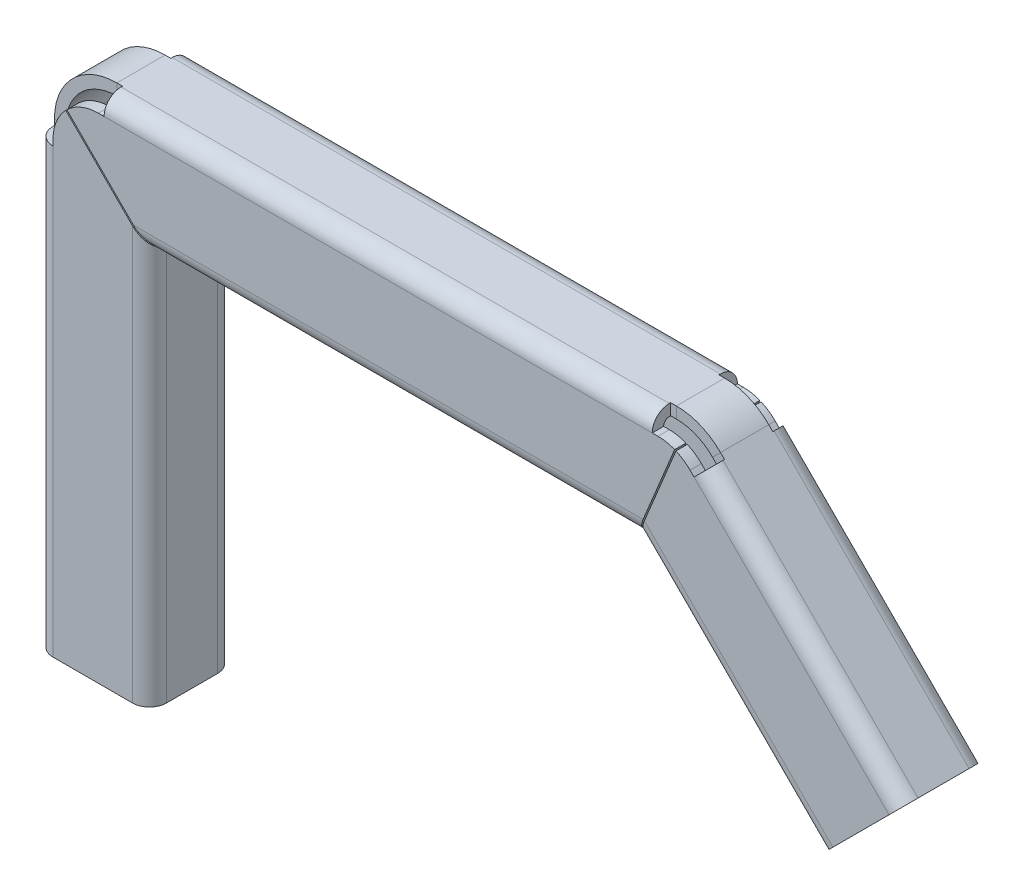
ISO-10303-21;
HEADER;
FILE_DESCRIPTION(('STEP AP214'),'2;1');
FILE_NAME('part.step','',(''),(''),'','','');
FILE_SCHEMA(('AUTOMOTIVE_DESIGN { 1 0 10303 214 1 1 1 1 }'));
ENDSEC;
DATA;
#1=APPLICATION_CONTEXT('core data for automotive mechanical design processes');
#2=APPLICATION_PROTOCOL_DEFINITION('international standard','automotive_design',2000,#1);
#3=PRODUCT_CONTEXT('',#1,'mechanical');
#4=PRODUCT('Part','Part','',(#3));
#5=PRODUCT_RELATED_PRODUCT_CATEGORY('part','',(#4));
#6=PRODUCT_DEFINITION_FORMATION('','',#4);
#7=PRODUCT_DEFINITION_CONTEXT('part definition',#1,'design');
#8=PRODUCT_DEFINITION('design','',#6,#7);
#9=PRODUCT_DEFINITION_SHAPE('','',#8);
#10=(LENGTH_UNIT() NAMED_UNIT(*) SI_UNIT(.MILLI.,.METRE.));
#11=(NAMED_UNIT(*) PLANE_ANGLE_UNIT() SI_UNIT($,.RADIAN.));
#12=(NAMED_UNIT(*) SI_UNIT($,.STERADIAN.) SOLID_ANGLE_UNIT());
#13=UNCERTAINTY_MEASURE_WITH_UNIT(LENGTH_MEASURE(1.E-05),#10,'distance_accuracy_value','');
#14=(GEOMETRIC_REPRESENTATION_CONTEXT(3) GLOBAL_UNCERTAINTY_ASSIGNED_CONTEXT((#13)) GLOBAL_UNIT_ASSIGNED_CONTEXT((#10,
#11,#12)) REPRESENTATION_CONTEXT('',''));
#15=CARTESIAN_POINT('',(0.,0.,0.));
#16=DIRECTION('',(0.,0.,1.));
#17=DIRECTION('',(1.,0.,0.));
#18=AXIS2_PLACEMENT_3D('',#15,#16,#17);
#19=CARTESIAN_POINT('',(98.5857864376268,162.104614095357,233.309991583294));
#20=DIRECTION('',(1.,0.,0.));
#21=DIRECTION('',(0.,0.,-1.));
#22=AXIS2_PLACEMENT_3D('',#19,#20,#21);
#23=PLANE('',#22);
#24=DIRECTION('',(0.,0.,1.));
#25=VECTOR('',#24,1.);
#26=CARTESIAN_POINT('',(98.5857864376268,88.,-4.5));
#27=LINE('',#26,#25);
#28=CARTESIAN_POINT('',(98.5857864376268,88.,4.25));
#29=VERTEX_POINT('',#28);
#30=CARTESIAN_POINT('',(98.5857864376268,88.,4.5));
#31=VERTEX_POINT('',#30);
#32=EDGE_CURVE('E1188',#29,#31,#27,.T.);
#33=ORIENTED_EDGE('',*,*,#32,.F.);
#34=DIRECTION('',(0.,1.,0.));
#35=VECTOR('',#34,1.);
#36=CARTESIAN_POINT('',(98.5857864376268,88.,4.25));
#37=LINE('',#36,#35);
#38=CARTESIAN_POINT('',(98.5857864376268,90.,4.25));
#39=VERTEX_POINT('',#38);
#40=EDGE_CURVE('E731',#29,#39,#37,.T.);
#41=ORIENTED_EDGE('',*,*,#40,.T.);
#42=DIRECTION('',(0.,0.,1.));
#43=VECTOR('',#42,1.);
#44=CARTESIAN_POINT('',(98.5857864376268,90.,-4.5));
#45=LINE('',#44,#43);
#46=CARTESIAN_POINT('',(98.5857864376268,90.,4.5));
#47=VERTEX_POINT('',#46);
#48=EDGE_CURVE('E1032',#39,#47,#45,.T.);
#49=ORIENTED_EDGE('',*,*,#48,.T.);
#50=CARTESIAN_POINT('',(98.5857864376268,87.,4.5));
#51=DIRECTION('',(1.,0.,0.));
#52=DIRECTION('',(0.,0.,-1.));
#53=AXIS2_PLACEMENT_3D('',#50,#51,#52);
#54=CIRCLE('',#53,3.);
#55=CARTESIAN_POINT('',(98.5857864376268,87.,7.50000000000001));
#56=VERTEX_POINT('',#55);
#57=EDGE_CURVE('E1030',#47,#56,#54,.T.);
#58=ORIENTED_EDGE('',*,*,#57,.T.);
#59=DIRECTION('',(0.,0.,-1.));
#60=VECTOR('',#59,1.);
#61=CARTESIAN_POINT('',(98.5857864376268,87.,233.309991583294));
#62=LINE('',#61,#60);
#63=CARTESIAN_POINT('',(98.5857864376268,87.,5.50000000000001));
#64=VERTEX_POINT('',#63);
#65=EDGE_CURVE('E1005',#56,#64,#62,.T.);
#66=ORIENTED_EDGE('',*,*,#65,.T.);
#67=CARTESIAN_POINT('',(98.5857864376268,87.,4.5));
#68=DIRECTION('',(1.,0.,0.));
#69=DIRECTION('',(0.,0.,-1.));
#70=AXIS2_PLACEMENT_3D('',#67,#68,#69);
#71=CIRCLE('',#70,1.);
#72=EDGE_CURVE('E1024',#31,#64,#71,.T.);
#73=ORIENTED_EDGE('',*,*,#72,.F.);
#74=EDGE_LOOP('',(#33,#41,#49,#58,#66,#73));
#75=FACE_BOUND('',#74,.T.);
#76=ADVANCED_FACE('F65',(#75),#23,.T.);
#77=CARTESIAN_POINT('',(1.99999999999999,162.104614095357,233.309991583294));
#78=DIRECTION('',(-1.,0.,0.));
#79=DIRECTION('',(0.,-1.,0.));
#80=AXIS2_PLACEMENT_3D('',#77,#78,#79);
#81=PLANE('',#80);
#82=DIRECTION('',(0.,0.,-1.));
#83=VECTOR('',#82,1.);
#84=CARTESIAN_POINT('',(2.,90.,-4.5));
#85=LINE('',#84,#83);
#86=CARTESIAN_POINT('',(2.,90.,4.5));
#87=VERTEX_POINT('',#86);
#88=CARTESIAN_POINT('',(2.,90.,4.25));
#89=VERTEX_POINT('',#88);
#90=EDGE_CURVE('E1047',#87,#89,#85,.T.);
#91=ORIENTED_EDGE('',*,*,#90,.T.);
#92=DIRECTION('',(0.,-1.,0.));
#93=VECTOR('',#92,1.);
#94=CARTESIAN_POINT('',(2.,90.,4.25));
#95=LINE('',#94,#93);
#96=CARTESIAN_POINT('',(2.,88.,4.25));
#97=VERTEX_POINT('',#96);
#98=EDGE_CURVE('E781',#89,#97,#95,.T.);
#99=ORIENTED_EDGE('',*,*,#98,.T.);
#100=DIRECTION('',(0.,0.,-1.));
#101=VECTOR('',#100,1.);
#102=CARTESIAN_POINT('',(2.,88.,-4.5));
#103=LINE('',#102,#101);
#104=CARTESIAN_POINT('',(2.,88.,4.5));
#105=VERTEX_POINT('',#104);
#106=EDGE_CURVE('E12',#105,#97,#103,.T.);
#107=ORIENTED_EDGE('',*,*,#106,.F.);
#108=CARTESIAN_POINT('',(2.,87.,4.5));
#109=DIRECTION('',(-1.,0.,0.));
#110=DIRECTION('',(0.,-1.,0.));
#111=AXIS2_PLACEMENT_3D('',#108,#109,#110);
#112=CIRCLE('',#111,1.);
#113=CARTESIAN_POINT('',(2.,87.,5.50000000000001));
#114=VERTEX_POINT('',#113);
#115=EDGE_CURVE('E1038',#114,#105,#112,.T.);
#116=ORIENTED_EDGE('',*,*,#115,.F.);
#117=DIRECTION('',(0.,0.,-1.));
#118=VECTOR('',#117,1.);
#119=CARTESIAN_POINT('',(2.,87.,233.309991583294));
#120=LINE('',#119,#118);
#121=CARTESIAN_POINT('',(2.,87.,7.50000000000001));
#122=VERTEX_POINT('',#121);
#123=EDGE_CURVE('E1009',#122,#114,#120,.T.);
#124=ORIENTED_EDGE('',*,*,#123,.F.);
#125=CARTESIAN_POINT('',(2.,87.,4.5));
#126=DIRECTION('',(-1.,0.,0.));
#127=DIRECTION('',(0.,-1.,0.));
#128=AXIS2_PLACEMENT_3D('',#125,#126,#127);
#129=CIRCLE('',#128,3.);
#130=EDGE_CURVE('E1044',#122,#87,#129,.T.);
#131=ORIENTED_EDGE('',*,*,#130,.T.);
#132=EDGE_LOOP('',(#91,#99,#107,#116,#124,#131));
#133=FACE_BOUND('',#132,.T.);
#134=ADVANCED_FACE('F1278',(#133),#81,.T.);
#135=CARTESIAN_POINT('',(100.,87.,-7.5));
#136=DIRECTION('',(0.,0.,1.));
#137=DIRECTION('',(0.,-1.,0.));
#138=AXIS2_PLACEMENT_3D('',#135,#136,#137);
#139=PLANE('',#138);
#140=CARTESIAN_POINT('',(1.,79.,-7.50000000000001));
#141=DIRECTION('',(0.,0.,1.));
#142=DIRECTION('',(0.,-1.,0.));
#143=AXIS2_PLACEMENT_3D('',#140,#141,#142);
#144=CIRCLE('',#143,8.);
#145=CARTESIAN_POINT('',(1.,87.,-7.50000000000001));
#146=VERTEX_POINT('',#145);
#147=CARTESIAN_POINT('',(-4.56777532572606,84.7445520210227,-7.5));
#148=VERTEX_POINT('',#147);
#149=EDGE_CURVE('E1017',#146,#148,#144,.T.);
#150=ORIENTED_EDGE('',*,*,#149,.F.);
#151=DIRECTION('',(-1.,0.,0.));
#152=VECTOR('',#151,1.);
#153=CARTESIAN_POINT('',(100.,87.,-7.5));
#154=LINE('',#153,#152);
#155=CARTESIAN_POINT('',(2.,87.,-7.5));
#156=VERTEX_POINT('',#155);
#157=EDGE_CURVE('E1078',#156,#146,#154,.T.);
#158=ORIENTED_EDGE('',*,*,#157,.F.);
#159=DIRECTION('',(-1.,0.,0.));
#160=VECTOR('',#159,1.);
#161=CARTESIAN_POINT('',(100.,87.,-7.5));
#162=LINE('',#161,#160);
#163=CARTESIAN_POINT('',(98.5857864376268,87.,-7.50000000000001));
#164=VERTEX_POINT('',#163);
#165=EDGE_CURVE('E1174',#164,#156,#162,.T.);
#166=ORIENTED_EDGE('',*,*,#165,.F.);
#167=DIRECTION('',(-1.,0.,0.));
#168=VECTOR('',#167,1.);
#169=CARTESIAN_POINT('',(100.,87.,-7.5));
#170=LINE('',#169,#168);
#171=CARTESIAN_POINT('',(99.5857864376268,87.,-7.5));
#172=VERTEX_POINT('',#171);
#173=EDGE_CURVE('E1071',#172,#164,#170,.T.);
#174=ORIENTED_EDGE('',*,*,#173,.F.);
#175=CARTESIAN_POINT('',(99.5857864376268,79.,-7.50000000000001));
#176=DIRECTION('',(0.,0.,1.));
#177=DIRECTION('',(0.,-1.,0.));
#178=AXIS2_PLACEMENT_3D('',#175,#176,#177);
#179=CIRCLE('',#178,8.);
#180=CARTESIAN_POINT('',(102.531395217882,86.4379694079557,-7.50000000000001));
#181=VERTEX_POINT('',#180);
#182=EDGE_CURVE('E1064',#181,#172,#179,.T.);
#183=ORIENTED_EDGE('',*,*,#182,.F.);
#184=DIRECTION('',(0.382683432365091,0.923879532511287,0.));
#185=VECTOR('',#184,1.);
#186=CARTESIAN_POINT('',(102.359388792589,86.0227091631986,-7.5));
#187=LINE('',#186,#185);
#188=CARTESIAN_POINT('',(96.9652060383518,73.,-7.5));
#189=VERTEX_POINT('',#188);
#190=EDGE_CURVE('E1124',#189,#181,#187,.T.);
#191=ORIENTED_EDGE('',*,*,#190,.F.);
#192=DIRECTION('',(-1.,0.,0.));
#193=VECTOR('',#192,1.);
#194=CARTESIAN_POINT('',(100.,73.,-7.5));
#195=LINE('',#194,#193);
#196=CARTESIAN_POINT('',(7.17677669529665,73.,-7.5));
#197=VERTEX_POINT('',#196);
#198=EDGE_CURVE('E1177',#189,#197,#195,.T.);
#199=ORIENTED_EDGE('',*,*,#198,.T.);
#200=DIRECTION('',(0.707106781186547,-0.707106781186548,0.));
#201=VECTOR('',#200,1.);
#202=CARTESIAN_POINT('',(46.5883883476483,33.5883883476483,-7.50000000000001));
#203=LINE('',#202,#201);
#204=EDGE_CURVE('E1103',#148,#197,#203,.T.);
#205=ORIENTED_EDGE('',*,*,#204,.F.);
#206=EDGE_LOOP('',(#150,#158,#166,#174,#183,#191,#199,#205));
#207=FACE_BOUND('',#206,.T.);
#208=ADVANCED_FACE('F1223',(#207),#139,.F.);
#209=CARTESIAN_POINT('',(100.,87.,-4.5));
#210=DIRECTION('',(-1.,0.,0.));
#211=DIRECTION('',(0.,0.,1.));
#212=AXIS2_PLACEMENT_3D('',#209,#210,#211);
#213=CYLINDRICAL_SURFACE('',#212,3.);
#214=CARTESIAN_POINT('',(2.,87.,-4.5));
#215=DIRECTION('',(-1.,0.,0.));
#216=DIRECTION('',(0.,-1.,0.));
#217=AXIS2_PLACEMENT_3D('',#214,#215,#216);
#218=CIRCLE('',#217,3.);
#219=CARTESIAN_POINT('',(2.,90.,-4.5));
#220=VERTEX_POINT('',#219);
#221=EDGE_CURVE('E1050',#220,#156,#218,.T.);
#222=ORIENTED_EDGE('',*,*,#221,.F.);
#223=DIRECTION('',(-1.,0.,0.));
#224=VECTOR('',#223,1.);
#225=CARTESIAN_POINT('',(100.,90.,-4.5));
#226=LINE('',#225,#224);
#227=CARTESIAN_POINT('',(98.5857864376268,90.,-4.5));
#228=VERTEX_POINT('',#227);
#229=EDGE_CURVE('E1171',#228,#220,#226,.T.);
#230=ORIENTED_EDGE('',*,*,#229,.F.);
#231=CARTESIAN_POINT('',(98.5857864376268,87.,-4.5));
#232=DIRECTION('',(1.,0.,0.));
#233=DIRECTION('',(0.,0.,-1.));
#234=AXIS2_PLACEMENT_3D('',#231,#232,#233);
#235=CIRCLE('',#234,3.);
#236=EDGE_CURVE('E1036',#164,#228,#235,.T.);
#237=ORIENTED_EDGE('',*,*,#236,.F.);
#238=ORIENTED_EDGE('',*,*,#165,.T.);
#239=EDGE_LOOP('',(#222,#230,#237,#238));
#240=FACE_BOUND('',#239,.T.);
#241=ADVANCED_FACE('F1299',(#240),#213,.T.);
#242=CARTESIAN_POINT('',(100.,90.,-4.5));
#243=DIRECTION('',(0.,-1.,0.));
#244=DIRECTION('',(0.,0.,-1.));
#245=AXIS2_PLACEMENT_3D('',#242,#243,#244);
#246=PLANE('',#245);
#247=ORIENTED_EDGE('',*,*,#90,.F.);
#248=DIRECTION('',(-1.,0.,0.));
#249=VECTOR('',#248,1.);
#250=CARTESIAN_POINT('',(100.,90.,4.5));
#251=LINE('',#250,#249);
#252=EDGE_CURVE('E1168',#47,#87,#251,.T.);
#253=ORIENTED_EDGE('',*,*,#252,.F.);
#254=ORIENTED_EDGE('',*,*,#48,.F.);
#255=DIRECTION('',(1.,0.,0.));
#256=VECTOR('',#255,1.);
#257=CARTESIAN_POINT('',(98.5857864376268,90.,4.25));
#258=LINE('',#257,#256);
#259=CARTESIAN_POINT('',(99.5857864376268,90.,4.25));
#260=VERTEX_POINT('',#259);
#261=EDGE_CURVE('E80',#39,#260,#258,.T.);
#262=ORIENTED_EDGE('',*,*,#261,.T.);
#263=DIRECTION('',(0.,0.,-1.));
#264=VECTOR('',#263,1.);
#265=CARTESIAN_POINT('',(99.5857864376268,90.,4.25));
#266=LINE('',#265,#264);
#267=CARTESIAN_POINT('',(99.5857864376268,90.,-4.25));
#268=VERTEX_POINT('',#267);
#269=EDGE_CURVE('E765',#260,#268,#266,.T.);
#270=ORIENTED_EDGE('',*,*,#269,.T.);
#271=DIRECTION('',(1.,0.,0.));
#272=VECTOR('',#271,1.);
#273=CARTESIAN_POINT('',(98.5857864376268,90.,-4.25));
#274=LINE('',#273,#272);
#275=CARTESIAN_POINT('',(98.5857864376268,90.,-4.25));
#276=VERTEX_POINT('',#275);
#277=EDGE_CURVE('E749',#276,#268,#274,.T.);
#278=ORIENTED_EDGE('',*,*,#277,.F.);
#279=EDGE_CURVE('E1033',#228,#276,#45,.T.);
#280=ORIENTED_EDGE('',*,*,#279,.F.);
#281=ORIENTED_EDGE('',*,*,#229,.T.);
#282=CARTESIAN_POINT('',(2.,90.,-4.25));
#283=VERTEX_POINT('',#282);
#284=EDGE_CURVE('E1046',#283,#220,#85,.T.);
#285=ORIENTED_EDGE('',*,*,#284,.F.);
#286=DIRECTION('',(1.,0.,0.));
#287=VECTOR('',#286,1.);
#288=CARTESIAN_POINT('',(1.,90.,-4.25));
#289=LINE('',#288,#287);
#290=CARTESIAN_POINT('',(1.,90.,-4.25));
#291=VERTEX_POINT('',#290);
#292=EDGE_CURVE('E807',#291,#283,#289,.T.);
#293=ORIENTED_EDGE('',*,*,#292,.F.);
#294=DIRECTION('',(0.,0.,-1.));
#295=VECTOR('',#294,1.);
#296=CARTESIAN_POINT('',(1.,90.,4.25));
#297=LINE('',#296,#295);
#298=CARTESIAN_POINT('',(1.,90.,4.25));
#299=VERTEX_POINT('',#298);
#300=EDGE_CURVE('E831',#299,#291,#297,.T.);
#301=ORIENTED_EDGE('',*,*,#300,.F.);
#302=DIRECTION('',(1.,0.,0.));
#303=VECTOR('',#302,1.);
#304=CARTESIAN_POINT('',(1.,90.,4.25));
#305=LINE('',#304,#303);
#306=EDGE_CURVE('E784',#299,#89,#305,.T.);
#307=ORIENTED_EDGE('',*,*,#306,.T.);
#308=EDGE_LOOP('',(#247,#253,#254,#262,#270,#278,#280,#281,#285,#293,#301,#307));
#309=FACE_BOUND('',#308,.T.);
#310=ADVANCED_FACE('F1274',(#309),#246,.F.);
#311=CARTESIAN_POINT('',(100.,87.,4.5));
#312=DIRECTION('',(-1.,0.,0.));
#313=DIRECTION('',(0.,0.,1.));
#314=AXIS2_PLACEMENT_3D('',#311,#312,#313);
#315=CYLINDRICAL_SURFACE('',#314,3.);
#316=ORIENTED_EDGE('',*,*,#130,.F.);
#317=DIRECTION('',(-1.,0.,0.));
#318=VECTOR('',#317,1.);
#319=CARTESIAN_POINT('',(100.,87.,7.5));
#320=LINE('',#319,#318);
#321=EDGE_CURVE('E1165',#56,#122,#320,.T.);
#322=ORIENTED_EDGE('',*,*,#321,.F.);
#323=ORIENTED_EDGE('',*,*,#57,.F.);
#324=ORIENTED_EDGE('',*,*,#252,.T.);
#325=EDGE_LOOP('',(#316,#322,#323,#324));
#326=FACE_BOUND('',#325,.T.);
#327=ADVANCED_FACE('F1270',(#326),#315,.T.);
#328=CARTESIAN_POINT('',(100.,87.,7.5));
#329=DIRECTION('',(0.,0.,-1.));
#330=DIRECTION('',(0.,1.,0.));
#331=AXIS2_PLACEMENT_3D('',#328,#329,#330);
#332=PLANE('',#331);
#333=CARTESIAN_POINT('',(1.,79.,7.50000000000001));
#334=DIRECTION('',(0.,0.,-1.));
#335=DIRECTION('',(0.,1.,0.));
#336=AXIS2_PLACEMENT_3D('',#333,#334,#335);
#337=CIRCLE('',#336,8.);
#338=CARTESIAN_POINT('',(-4.56777532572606,84.7445520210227,7.50000000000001));
#339=VERTEX_POINT('',#338);
#340=CARTESIAN_POINT('',(1.,87.,7.50000000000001));
#341=VERTEX_POINT('',#340);
#342=EDGE_CURVE('E1022',#339,#341,#337,.T.);
#343=ORIENTED_EDGE('',*,*,#342,.F.);
#344=DIRECTION('',(-0.707106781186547,0.707106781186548,0.));
#345=VECTOR('',#344,1.);
#346=CARTESIAN_POINT('',(46.5883883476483,33.5883883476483,7.5));
#347=LINE('',#346,#345);
#348=CARTESIAN_POINT('',(7.17677669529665,73.,7.5));
#349=VERTEX_POINT('',#348);
#350=EDGE_CURVE('E1105',#349,#339,#347,.T.);
#351=ORIENTED_EDGE('',*,*,#350,.F.);
#352=DIRECTION('',(-1.,0.,0.));
#353=VECTOR('',#352,1.);
#354=CARTESIAN_POINT('',(100.,73.,7.5));
#355=LINE('',#354,#353);
#356=CARTESIAN_POINT('',(96.9652060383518,73.,7.5));
#357=VERTEX_POINT('',#356);
#358=EDGE_CURVE('E1136',#357,#349,#355,.T.);
#359=ORIENTED_EDGE('',*,*,#358,.F.);
#360=DIRECTION('',(-0.382683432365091,-0.923879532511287,0.));
#361=VECTOR('',#360,1.);
#362=CARTESIAN_POINT('',(102.359388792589,86.0227091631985,7.5));
#363=LINE('',#362,#361);
#364=CARTESIAN_POINT('',(102.531395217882,86.4379694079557,7.50000000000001));
#365=VERTEX_POINT('',#364);
#366=EDGE_CURVE('E1122',#365,#357,#363,.T.);
#367=ORIENTED_EDGE('',*,*,#366,.F.);
#368=CARTESIAN_POINT('',(99.5857864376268,79.,7.50000000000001));
#369=DIRECTION('',(0.,0.,-1.));
#370=DIRECTION('',(0.,1.,0.));
#371=AXIS2_PLACEMENT_3D('',#368,#369,#370);
#372=CIRCLE('',#371,8.);
#373=CARTESIAN_POINT('',(99.5857864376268,87.,7.50000000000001));
#374=VERTEX_POINT('',#373);
#375=EDGE_CURVE('E1058',#374,#365,#372,.T.);
#376=ORIENTED_EDGE('',*,*,#375,.F.);
#377=DIRECTION('',(1.,0.,0.));
#378=VECTOR('',#377,1.);
#379=CARTESIAN_POINT('',(100.,87.,7.5));
#380=LINE('',#379,#378);
#381=EDGE_CURVE('E1069',#56,#374,#380,.T.);
#382=ORIENTED_EDGE('',*,*,#381,.F.);
#383=ORIENTED_EDGE('',*,*,#321,.T.);
#384=DIRECTION('',(1.,0.,0.));
#385=VECTOR('',#384,1.);
#386=CARTESIAN_POINT('',(100.,87.,7.5));
#387=LINE('',#386,#385);
#388=EDGE_CURVE('E1076',#341,#122,#387,.T.);
#389=ORIENTED_EDGE('',*,*,#388,.F.);
#390=EDGE_LOOP('',(#343,#351,#359,#367,#376,#382,#383,#389));
#391=FACE_BOUND('',#390,.T.);
#392=ADVANCED_FACE('F1242',(#391),#332,.F.);
#393=CARTESIAN_POINT('',(99.8845150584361,80.0478354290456,0.));
#394=DIRECTION('',(0.923879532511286,-0.382683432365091,0.));
#395=DIRECTION('',(0.382683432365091,0.923879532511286,0.));
#396=AXIS2_PLACEMENT_3D('',#393,#394,#395);
#397=PLANE('',#396);
#398=ORIENTED_EDGE('',*,*,#190,.T.);
#399=DIRECTION('',(0.,0.,-1.));
#400=VECTOR('',#399,1.);
#401=CARTESIAN_POINT('',(102.531395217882,86.4379694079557,233.309991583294));
#402=LINE('',#401,#400);
#403=CARTESIAN_POINT('',(102.531395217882,86.4379694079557,-5.5));
#404=VERTEX_POINT('',#403);
#405=EDGE_CURVE('E1059',#181,#404,#402,.F.);
#406=ORIENTED_EDGE('',*,*,#405,.T.);
#407=DIRECTION('',(0.382683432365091,0.923879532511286,0.));
#408=VECTOR('',#407,1.);
#409=CARTESIAN_POINT('',(102.359388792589,86.0227091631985,-5.5));
#410=LINE('',#409,#408);
#411=CARTESIAN_POINT('',(96.9652060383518,73.,-5.50000000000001));
#412=VERTEX_POINT('',#411);
#413=EDGE_CURVE('E1119',#412,#404,#410,.T.);
#414=ORIENTED_EDGE('',*,*,#413,.F.);
#415=CARTESIAN_POINT('',(96.9652060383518,73.,-4.5));
#416=DIRECTION('',(0.923879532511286,-0.382683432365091,0.));
#417=DIRECTION('',(-0.382683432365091,-0.923879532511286,0.));
#418=AXIS2_PLACEMENT_3D('',#415,#416,#417);
#419=ELLIPSE('',#418,1.0823922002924,1.);
#420=CARTESIAN_POINT('',(96.5509924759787,72.,-4.5));
#421=VERTEX_POINT('',#420);
#422=EDGE_CURVE('E1116',#421,#412,#419,.T.);
#423=ORIENTED_EDGE('',*,*,#422,.F.);
#424=DIRECTION('',(0.,0.,-1.));
#425=VECTOR('',#424,1.);
#426=CARTESIAN_POINT('',(96.5509924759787,72.,-4.5));
#427=LINE('',#426,#425);
#428=CARTESIAN_POINT('',(96.5509924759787,72.,4.5));
#429=VERTEX_POINT('',#428);
#430=EDGE_CURVE('E1113',#429,#421,#427,.T.);
#431=ORIENTED_EDGE('',*,*,#430,.F.);
#432=CARTESIAN_POINT('',(96.9652060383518,73.,4.5));
#433=DIRECTION('',(0.923879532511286,-0.382683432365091,0.));
#434=DIRECTION('',(-0.382683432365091,-0.923879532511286,0.));
#435=AXIS2_PLACEMENT_3D('',#432,#433,#434);
#436=ELLIPSE('',#435,1.0823922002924,1.);
#437=CARTESIAN_POINT('',(96.9652060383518,73.,5.5));
#438=VERTEX_POINT('',#437);
#439=EDGE_CURVE('E1110',#438,#429,#436,.T.);
#440=ORIENTED_EDGE('',*,*,#439,.F.);
#441=DIRECTION('',(-0.382683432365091,-0.923879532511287,0.));
#442=VECTOR('',#441,1.);
#443=CARTESIAN_POINT('',(102.359388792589,86.0227091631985,5.50000000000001));
#444=LINE('',#443,#442);
#445=CARTESIAN_POINT('',(102.531395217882,86.4379694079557,5.50000000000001));
#446=VERTEX_POINT('',#445);
#447=EDGE_CURVE('E1108',#446,#438,#444,.T.);
#448=ORIENTED_EDGE('',*,*,#447,.F.);
#449=EDGE_CURVE('E1055',#446,#365,#402,.F.);
#450=ORIENTED_EDGE('',*,*,#449,.T.);
#451=ORIENTED_EDGE('',*,*,#366,.T.);
#452=CARTESIAN_POINT('',(96.9652060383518,73.,4.5));
#453=DIRECTION('',(0.923879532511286,-0.382683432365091,0.));
#454=DIRECTION('',(-0.382683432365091,-0.923879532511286,0.));
#455=AXIS2_PLACEMENT_3D('',#452,#453,#454);
#456=ELLIPSE('',#455,3.24717660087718,3.);
#457=CARTESIAN_POINT('',(95.7225653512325,70.,4.5));
#458=VERTEX_POINT('',#457);
#459=EDGE_CURVE('E1133',#357,#458,#456,.T.);
#460=ORIENTED_EDGE('',*,*,#459,.T.);
#461=DIRECTION('',(0.,0.,-1.));
#462=VECTOR('',#461,1.);
#463=CARTESIAN_POINT('',(95.7225653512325,70.,-4.5));
#464=LINE('',#463,#462);
#465=CARTESIAN_POINT('',(95.7225653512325,70.,-4.5));
#466=VERTEX_POINT('',#465);
#467=EDGE_CURVE('E1130',#458,#466,#464,.T.);
#468=ORIENTED_EDGE('',*,*,#467,.T.);
#469=CARTESIAN_POINT('',(96.9652060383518,73.,-4.5));
#470=DIRECTION('',(0.923879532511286,-0.382683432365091,0.));
#471=DIRECTION('',(-0.382683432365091,-0.923879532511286,0.));
#472=AXIS2_PLACEMENT_3D('',#469,#470,#471);
#473=ELLIPSE('',#472,3.24717660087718,3.);
#474=EDGE_CURVE('E1127',#466,#189,#473,.T.);
#475=ORIENTED_EDGE('',*,*,#474,.T.);
#476=EDGE_LOOP('',(#398,#406,#414,#423,#431,#440,#448,#450,#451,#460,#468,#475));
#477=FACE_BOUND('',#476,.T.);
#478=ADVANCED_FACE('F1231',(#477),#397,.T.);
#479=CARTESIAN_POINT('',(100.,87.,-4.5));
#480=DIRECTION('',(-1.,0.,0.));
#481=DIRECTION('',(0.,0.,1.));
#482=AXIS2_PLACEMENT_3D('',#479,#480,#481);
#483=CYLINDRICAL_SURFACE('',#482,1.);
#484=DIRECTION('',(-1.,0.,0.));
#485=VECTOR('',#484,1.);
#486=CARTESIAN_POINT('',(100.,88.,-4.5));
#487=LINE('',#486,#485);
#488=CARTESIAN_POINT('',(98.5857864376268,88.,-4.5));
#489=VERTEX_POINT('',#488);
#490=CARTESIAN_POINT('',(2.,88.,-4.5));
#491=VERTEX_POINT('',#490);
#492=EDGE_CURVE('E1137',#489,#491,#487,.T.);
#493=ORIENTED_EDGE('',*,*,#492,.T.);
#494=CARTESIAN_POINT('',(2.,87.,-4.5));
#495=DIRECTION('',(-1.,0.,0.));
#496=DIRECTION('',(0.,-1.,0.));
#497=AXIS2_PLACEMENT_3D('',#494,#495,#496);
#498=CIRCLE('',#497,1.);
#499=CARTESIAN_POINT('',(2.,87.,-5.50000000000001));
#500=VERTEX_POINT('',#499);
#501=EDGE_CURVE('E1041',#491,#500,#498,.T.);
#502=ORIENTED_EDGE('',*,*,#501,.T.);
#503=DIRECTION('',(-1.,0.,0.));
#504=VECTOR('',#503,1.);
#505=CARTESIAN_POINT('',(100.,87.,-5.5));
#506=LINE('',#505,#504);
#507=CARTESIAN_POINT('',(98.5857864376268,87.,-5.50000000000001));
#508=VERTEX_POINT('',#507);
#509=EDGE_CURVE('E1160',#508,#500,#506,.T.);
#510=ORIENTED_EDGE('',*,*,#509,.F.);
#511=CARTESIAN_POINT('',(98.5857864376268,87.,-4.5));
#512=DIRECTION('',(1.,0.,0.));
#513=DIRECTION('',(0.,0.,-1.));
#514=AXIS2_PLACEMENT_3D('',#511,#512,#513);
#515=CIRCLE('',#514,1.);
#516=EDGE_CURVE('E1027',#508,#489,#515,.T.);
#517=ORIENTED_EDGE('',*,*,#516,.T.);
#518=EDGE_LOOP('',(#493,#502,#510,#517));
#519=FACE_BOUND('',#518,.T.);
#520=ADVANCED_FACE('F1479',(#519),#483,.F.);
#521=CARTESIAN_POINT('',(100.,87.,-5.5));
#522=DIRECTION('',(0.,0.,1.));
#523=DIRECTION('',(0.,-1.,0.));
#524=AXIS2_PLACEMENT_3D('',#521,#522,#523);
#525=PLANE('',#524);
#526=DIRECTION('',(-1.,0.,0.));
#527=VECTOR('',#526,1.);
#528=CARTESIAN_POINT('',(100.,87.,-5.5));
#529=LINE('',#528,#527);
#530=CARTESIAN_POINT('',(1.,87.,-5.50000000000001));
#531=VERTEX_POINT('',#530);
#532=EDGE_CURVE('E1073',#500,#531,#529,.T.);
#533=ORIENTED_EDGE('',*,*,#532,.T.);
#534=CARTESIAN_POINT('',(1.,79.,-5.50000000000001));
#535=DIRECTION('',(0.,0.,1.));
#536=DIRECTION('',(0.,-1.,0.));
#537=AXIS2_PLACEMENT_3D('',#534,#535,#536);
#538=CIRCLE('',#537,8.);
#539=CARTESIAN_POINT('',(-4.56777532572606,84.7445520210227,-5.50000000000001));
#540=VERTEX_POINT('',#539);
#541=EDGE_CURVE('E1014',#531,#540,#538,.T.);
#542=ORIENTED_EDGE('',*,*,#541,.T.);
#543=DIRECTION('',(0.707106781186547,-0.707106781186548,0.));
#544=VECTOR('',#543,1.);
#545=CARTESIAN_POINT('',(46.5883883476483,33.5883883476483,-5.50000000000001));
#546=LINE('',#545,#544);
#547=CARTESIAN_POINT('',(7.17677669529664,73.,-5.50000000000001));
#548=VERTEX_POINT('',#547);
#549=EDGE_CURVE('E1080',#540,#548,#546,.T.);
#550=ORIENTED_EDGE('',*,*,#549,.T.);
#551=DIRECTION('',(-1.,0.,0.));
#552=VECTOR('',#551,1.);
#553=CARTESIAN_POINT('',(100.,73.,-5.50000000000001));
#554=LINE('',#553,#552);
#555=EDGE_CURVE('E1157',#412,#548,#554,.T.);
#556=ORIENTED_EDGE('',*,*,#555,.F.);
#557=ORIENTED_EDGE('',*,*,#413,.T.);
#558=CARTESIAN_POINT('',(99.5857864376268,79.,-5.50000000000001));
#559=DIRECTION('',(0.,0.,1.));
#560=DIRECTION('',(0.,-1.,0.));
#561=AXIS2_PLACEMENT_3D('',#558,#559,#560);
#562=CIRCLE('',#561,8.);
#563=CARTESIAN_POINT('',(99.5857864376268,87.,-5.50000000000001));
#564=VERTEX_POINT('',#563);
#565=EDGE_CURVE('E1061',#404,#564,#562,.T.);
#566=ORIENTED_EDGE('',*,*,#565,.T.);
#567=DIRECTION('',(-1.,0.,0.));
#568=VECTOR('',#567,1.);
#569=CARTESIAN_POINT('',(100.,87.,-5.5));
#570=LINE('',#569,#568);
#571=EDGE_CURVE('E1066',#564,#508,#570,.T.);
#572=ORIENTED_EDGE('',*,*,#571,.T.);
#573=ORIENTED_EDGE('',*,*,#509,.T.);
#574=EDGE_LOOP('',(#533,#542,#550,#556,#557,#566,#572,#573));
#575=FACE_BOUND('',#574,.T.);
#576=ADVANCED_FACE('F1217',(#575),#525,.T.);
#577=CARTESIAN_POINT('',(100.,87.,5.50000000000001));
#578=DIRECTION('',(0.,0.,-1.));
#579=DIRECTION('',(0.,1.,0.));
#580=AXIS2_PLACEMENT_3D('',#577,#578,#579);
#581=PLANE('',#580);
#582=DIRECTION('',(-0.707106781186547,0.707106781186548,0.));
#583=VECTOR('',#582,1.);
#584=CARTESIAN_POINT('',(46.5883883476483,33.5883883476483,5.5));
#585=LINE('',#584,#583);
#586=CARTESIAN_POINT('',(7.17677669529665,73.,5.5));
#587=VERTEX_POINT('',#586);
#588=CARTESIAN_POINT('',(-4.56777532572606,84.7445520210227,5.50000000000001));
#589=VERTEX_POINT('',#588);
#590=EDGE_CURVE('E1091',#587,#589,#585,.T.);
#591=ORIENTED_EDGE('',*,*,#590,.T.);
#592=CARTESIAN_POINT('',(1.,79.,5.50000000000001));
#593=DIRECTION('',(0.,0.,-1.));
#594=DIRECTION('',(0.,1.,0.));
#595=AXIS2_PLACEMENT_3D('',#592,#593,#594);
#596=CIRCLE('',#595,8.);
#597=CARTESIAN_POINT('',(1.,87.,5.50000000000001));
#598=VERTEX_POINT('',#597);
#599=EDGE_CURVE('E1019',#589,#598,#596,.T.);
#600=ORIENTED_EDGE('',*,*,#599,.T.);
#601=DIRECTION('',(-1.,0.,0.));
#602=VECTOR('',#601,1.);
#603=CARTESIAN_POINT('',(100.,87.,5.50000000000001));
#604=LINE('',#603,#602);
#605=EDGE_CURVE('E1144',#114,#598,#604,.T.);
#606=ORIENTED_EDGE('',*,*,#605,.F.);
#607=EDGE_CURVE('E1146',#64,#114,#604,.T.);
#608=ORIENTED_EDGE('',*,*,#607,.F.);
#609=CARTESIAN_POINT('',(99.5857864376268,87.,5.50000000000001));
#610=VERTEX_POINT('',#609);
#611=EDGE_CURVE('E1147',#610,#64,#604,.T.);
#612=ORIENTED_EDGE('',*,*,#611,.F.);
#613=CARTESIAN_POINT('',(99.5857864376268,79.,5.50000000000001));
#614=DIRECTION('',(0.,0.,-1.));
#615=DIRECTION('',(0.,1.,0.));
#616=AXIS2_PLACEMENT_3D('',#613,#614,#615);
#617=CIRCLE('',#616,8.);
#618=EDGE_CURVE('E1052',#610,#446,#617,.T.);
#619=ORIENTED_EDGE('',*,*,#618,.T.);
#620=ORIENTED_EDGE('',*,*,#447,.T.);
#621=DIRECTION('',(-1.,0.,0.));
#622=VECTOR('',#621,1.);
#623=CARTESIAN_POINT('',(100.,73.,5.5));
#624=LINE('',#623,#622);
#625=EDGE_CURVE('E1148',#438,#587,#624,.T.);
#626=ORIENTED_EDGE('',*,*,#625,.T.);
#627=EDGE_LOOP('',(#591,#600,#606,#608,#612,#619,#620,#626));
#628=FACE_BOUND('',#627,.T.);
#629=ADVANCED_FACE('F1200',(#628),#581,.T.);
#630=CARTESIAN_POINT('',(100.,87.,4.5));
#631=DIRECTION('',(-1.,0.,0.));
#632=DIRECTION('',(0.,0.,1.));
#633=AXIS2_PLACEMENT_3D('',#630,#631,#632);
#634=CYLINDRICAL_SURFACE('',#633,1.);
#635=ORIENTED_EDGE('',*,*,#607,.T.);
#636=ORIENTED_EDGE('',*,*,#115,.T.);
#637=DIRECTION('',(-1.,0.,0.));
#638=VECTOR('',#637,1.);
#639=CARTESIAN_POINT('',(100.,88.,4.5));
#640=LINE('',#639,#638);
#641=EDGE_CURVE('E1140',#31,#105,#640,.T.);
#642=ORIENTED_EDGE('',*,*,#641,.F.);
#643=ORIENTED_EDGE('',*,*,#72,.T.);
#644=EDGE_LOOP('',(#635,#636,#642,#643));
#645=FACE_BOUND('',#644,.T.);
#646=ADVANCED_FACE('F1255',(#645),#634,.F.);
#647=CARTESIAN_POINT('',(100.,88.,-4.5));
#648=DIRECTION('',(0.,-1.,0.));
#649=DIRECTION('',(0.,0.,-1.));
#650=AXIS2_PLACEMENT_3D('',#647,#648,#649);
#651=PLANE('',#650);
#652=ORIENTED_EDGE('',*,*,#641,.T.);
#653=ORIENTED_EDGE('',*,*,#106,.T.);
#654=DIRECTION('',(1.,0.,0.));
#655=VECTOR('',#654,1.);
#656=CARTESIAN_POINT('',(1.,88.,4.25));
#657=LINE('',#656,#655);
#658=CARTESIAN_POINT('',(1.,88.,4.25));
#659=VERTEX_POINT('',#658);
#660=EDGE_CURVE('E88',#659,#97,#657,.T.);
#661=ORIENTED_EDGE('',*,*,#660,.F.);
#662=DIRECTION('',(0.,0.,-1.));
#663=VECTOR('',#662,1.);
#664=CARTESIAN_POINT('',(1.,88.,4.25));
#665=LINE('',#664,#663);
#666=CARTESIAN_POINT('',(1.,88.,-4.25));
#667=VERTEX_POINT('',#666);
#668=EDGE_CURVE('E802',#659,#667,#665,.T.);
#669=ORIENTED_EDGE('',*,*,#668,.T.);
#670=DIRECTION('',(1.,0.,0.));
#671=VECTOR('',#670,1.);
#672=CARTESIAN_POINT('',(1.,88.,-4.25));
#673=LINE('',#672,#671);
#674=CARTESIAN_POINT('',(2.,88.,-4.25));
#675=VERTEX_POINT('',#674);
#676=EDGE_CURVE('E779',#667,#675,#673,.T.);
#677=ORIENTED_EDGE('',*,*,#676,.T.);
#678=EDGE_CURVE('E73',#675,#491,#103,.T.);
#679=ORIENTED_EDGE('',*,*,#678,.T.);
#680=ORIENTED_EDGE('',*,*,#492,.F.);
#681=CARTESIAN_POINT('',(98.5857864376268,88.,-4.25));
#682=VERTEX_POINT('',#681);
#683=EDGE_CURVE('E1186',#489,#682,#27,.T.);
#684=ORIENTED_EDGE('',*,*,#683,.T.);
#685=DIRECTION('',(1.,0.,0.));
#686=VECTOR('',#685,1.);
#687=CARTESIAN_POINT('',(98.5857864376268,88.,-4.25));
#688=LINE('',#687,#686);
#689=CARTESIAN_POINT('',(99.5857864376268,88.,-4.25));
#690=VERTEX_POINT('',#689);
#691=EDGE_CURVE('E755',#682,#690,#688,.T.);
#692=ORIENTED_EDGE('',*,*,#691,.T.);
#693=DIRECTION('',(0.,0.,-1.));
#694=VECTOR('',#693,1.);
#695=CARTESIAN_POINT('',(99.5857864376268,88.,4.25));
#696=LINE('',#695,#694);
#697=CARTESIAN_POINT('',(99.5857864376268,88.,4.25));
#698=VERTEX_POINT('',#697);
#699=EDGE_CURVE('E762',#698,#690,#696,.T.);
#700=ORIENTED_EDGE('',*,*,#699,.F.);
#701=DIRECTION('',(1.,0.,0.));
#702=VECTOR('',#701,1.);
#703=CARTESIAN_POINT('',(98.5857864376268,88.,4.25));
#704=LINE('',#703,#702);
#705=EDGE_CURVE('E733',#29,#698,#704,.T.);
#706=ORIENTED_EDGE('',*,*,#705,.F.);
#707=ORIENTED_EDGE('',*,*,#32,.T.);
#708=EDGE_LOOP('',(#652,#653,#661,#669,#677,#679,#680,#684,#692,#700,#706,#707));
#709=FACE_BOUND('',#708,.T.);
#710=ADVANCED_FACE('F1305',(#709),#651,.T.);
#711=CARTESIAN_POINT('',(0.0883883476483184,80.0883883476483,0.));
#712=DIRECTION('',(-0.707106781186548,-0.707106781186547,0.));
#713=DIRECTION('',(0.707106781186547,-0.707106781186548,0.));
#714=AXIS2_PLACEMENT_3D('',#711,#712,#713);
#715=PLANE('',#714);
#716=ORIENTED_EDGE('',*,*,#350,.T.);
#717=DIRECTION('',(0.,0.,-1.));
#718=VECTOR('',#717,1.);
#719=CARTESIAN_POINT('',(-4.56777532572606,84.7445520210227,233.309991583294));
#720=LINE('',#719,#718);
#721=EDGE_CURVE('E1185',#339,#589,#720,.T.);
#722=ORIENTED_EDGE('',*,*,#721,.T.);
#723=ORIENTED_EDGE('',*,*,#590,.F.);
#724=CARTESIAN_POINT('',(7.17677669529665,73.,4.5));
#725=DIRECTION('',(-0.707106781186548,-0.707106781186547,0.));
#726=DIRECTION('',(-0.707106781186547,0.707106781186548,0.));
#727=AXIS2_PLACEMENT_3D('',#724,#725,#726);
#728=ELLIPSE('',#727,1.4142135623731,1.);
#729=CARTESIAN_POINT('',(8.17677669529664,72.,4.5));
#730=VERTEX_POINT('',#729);
#731=EDGE_CURVE('E1088',#730,#587,#728,.T.);
#732=ORIENTED_EDGE('',*,*,#731,.F.);
#733=DIRECTION('',(0.,0.,1.));
#734=VECTOR('',#733,1.);
#735=CARTESIAN_POINT('',(8.17677669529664,72.,-4.49999999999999));
#736=LINE('',#735,#734);
#737=CARTESIAN_POINT('',(8.17677669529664,72.,-4.5));
#738=VERTEX_POINT('',#737);
#739=EDGE_CURVE('E1085',#738,#730,#736,.T.);
#740=ORIENTED_EDGE('',*,*,#739,.F.);
#741=CARTESIAN_POINT('',(7.17677669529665,73.,-4.5));
#742=DIRECTION('',(-0.707106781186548,-0.707106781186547,0.));
#743=DIRECTION('',(-0.707106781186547,0.707106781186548,0.));
#744=AXIS2_PLACEMENT_3D('',#741,#742,#743);
#745=ELLIPSE('',#744,1.4142135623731,1.);
#746=EDGE_CURVE('E1082',#548,#738,#745,.T.);
#747=ORIENTED_EDGE('',*,*,#746,.F.);
#748=ORIENTED_EDGE('',*,*,#549,.F.);
#749=EDGE_CURVE('E1163',#540,#148,#720,.T.);
#750=ORIENTED_EDGE('',*,*,#749,.T.);
#751=ORIENTED_EDGE('',*,*,#204,.T.);
#752=CARTESIAN_POINT('',(7.17677669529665,73.,-4.5));
#753=DIRECTION('',(-0.707106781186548,-0.707106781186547,0.));
#754=DIRECTION('',(-0.707106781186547,0.707106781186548,0.));
#755=AXIS2_PLACEMENT_3D('',#752,#753,#754);
#756=ELLIPSE('',#755,4.24264068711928,3.);
#757=CARTESIAN_POINT('',(10.1767766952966,70.,-4.5));
#758=VERTEX_POINT('',#757);
#759=EDGE_CURVE('E1100',#197,#758,#756,.T.);
#760=ORIENTED_EDGE('',*,*,#759,.T.);
#761=DIRECTION('',(0.,0.,1.));
#762=VECTOR('',#761,1.);
#763=CARTESIAN_POINT('',(10.1767766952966,70.,-4.49999999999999));
#764=LINE('',#763,#762);
#765=CARTESIAN_POINT('',(10.1767766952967,70.,4.5));
#766=VERTEX_POINT('',#765);
#767=EDGE_CURVE('E1097',#758,#766,#764,.T.);
#768=ORIENTED_EDGE('',*,*,#767,.T.);
#769=CARTESIAN_POINT('',(7.17677669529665,73.,4.5));
#770=DIRECTION('',(-0.707106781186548,-0.707106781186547,0.));
#771=DIRECTION('',(-0.707106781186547,0.707106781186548,0.));
#772=AXIS2_PLACEMENT_3D('',#769,#770,#771);
#773=ELLIPSE('',#772,4.24264068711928,3.);
#774=EDGE_CURVE('E1094',#766,#349,#773,.T.);
#775=ORIENTED_EDGE('',*,*,#774,.T.);
#776=EDGE_LOOP('',(#716,#722,#723,#732,#740,#747,#748,#750,#751,#760,#768,#775));
#777=FACE_BOUND('',#776,.T.);
#778=ADVANCED_FACE('F1195',(#777),#715,.T.);
#779=CARTESIAN_POINT('',(100.,73.,4.5));
#780=DIRECTION('',(-1.,0.,0.));
#781=DIRECTION('',(0.,0.,1.));
#782=AXIS2_PLACEMENT_3D('',#779,#780,#781);
#783=CYLINDRICAL_SURFACE('',#782,3.);
#784=ORIENTED_EDGE('',*,*,#774,.F.);
#785=DIRECTION('',(-1.,0.,0.));
#786=VECTOR('',#785,1.);
#787=CARTESIAN_POINT('',(100.,70.,4.5));
#788=LINE('',#787,#786);
#789=EDGE_CURVE('E1141',#458,#766,#788,.T.);
#790=ORIENTED_EDGE('',*,*,#789,.F.);
#791=ORIENTED_EDGE('',*,*,#459,.F.);
#792=ORIENTED_EDGE('',*,*,#358,.T.);
#793=EDGE_LOOP('',(#784,#790,#791,#792));
#794=FACE_BOUND('',#793,.T.);
#795=ADVANCED_FACE('F67',(#794),#783,.T.);
#796=CARTESIAN_POINT('',(100.,70.,-4.5));
#797=DIRECTION('',(0.,1.,0.));
#798=DIRECTION('',(0.,0.,1.));
#799=AXIS2_PLACEMENT_3D('',#796,#797,#798);
#800=PLANE('',#799);
#801=ORIENTED_EDGE('',*,*,#767,.F.);
#802=DIRECTION('',(-1.,0.,0.));
#803=VECTOR('',#802,1.);
#804=CARTESIAN_POINT('',(100.,70.,-4.5));
#805=LINE('',#804,#803);
#806=EDGE_CURVE('E1180',#466,#758,#805,.T.);
#807=ORIENTED_EDGE('',*,*,#806,.F.);
#808=ORIENTED_EDGE('',*,*,#467,.F.);
#809=ORIENTED_EDGE('',*,*,#789,.T.);
#810=EDGE_LOOP('',(#801,#807,#808,#809));
#811=FACE_BOUND('',#810,.T.);
#812=ADVANCED_FACE('F1236',(#811),#800,.F.);
#813=CARTESIAN_POINT('',(100.,73.,-4.5));
#814=DIRECTION('',(-1.,0.,0.));
#815=DIRECTION('',(0.,0.,1.));
#816=AXIS2_PLACEMENT_3D('',#813,#814,#815);
#817=CYLINDRICAL_SURFACE('',#816,3.);
#818=ORIENTED_EDGE('',*,*,#759,.F.);
#819=ORIENTED_EDGE('',*,*,#198,.F.);
#820=ORIENTED_EDGE('',*,*,#474,.F.);
#821=ORIENTED_EDGE('',*,*,#806,.T.);
#822=EDGE_LOOP('',(#818,#819,#820,#821));
#823=FACE_BOUND('',#822,.T.);
#824=ADVANCED_FACE('F1228',(#823),#817,.T.);
#825=CARTESIAN_POINT('',(100.,73.,-4.5));
#826=DIRECTION('',(-1.,0.,0.));
#827=DIRECTION('',(0.,0.,1.));
#828=AXIS2_PLACEMENT_3D('',#825,#826,#827);
#829=CYLINDRICAL_SURFACE('',#828,1.);
#830=ORIENTED_EDGE('',*,*,#555,.T.);
#831=ORIENTED_EDGE('',*,*,#746,.T.);
#832=DIRECTION('',(-1.,0.,0.));
#833=VECTOR('',#832,1.);
#834=CARTESIAN_POINT('',(100.,72.,-4.5));
#835=LINE('',#834,#833);
#836=EDGE_CURVE('E1154',#421,#738,#835,.T.);
#837=ORIENTED_EDGE('',*,*,#836,.F.);
#838=ORIENTED_EDGE('',*,*,#422,.T.);
#839=EDGE_LOOP('',(#830,#831,#837,#838));
#840=FACE_BOUND('',#839,.T.);
#841=ADVANCED_FACE('F1214',(#840),#829,.F.);
#842=CARTESIAN_POINT('',(100.,72.,-4.5));
#843=DIRECTION('',(0.,1.,0.));
#844=DIRECTION('',(0.,0.,1.));
#845=AXIS2_PLACEMENT_3D('',#842,#843,#844);
#846=PLANE('',#845);
#847=ORIENTED_EDGE('',*,*,#836,.T.);
#848=ORIENTED_EDGE('',*,*,#739,.T.);
#849=DIRECTION('',(-1.,0.,0.));
#850=VECTOR('',#849,1.);
#851=CARTESIAN_POINT('',(100.,72.,4.5));
#852=LINE('',#851,#850);
#853=EDGE_CURVE('E1151',#429,#730,#852,.T.);
#854=ORIENTED_EDGE('',*,*,#853,.F.);
#855=ORIENTED_EDGE('',*,*,#430,.T.);
#856=EDGE_LOOP('',(#847,#848,#854,#855));
#857=FACE_BOUND('',#856,.T.);
#858=ADVANCED_FACE('F1212',(#857),#846,.T.);
#859=CARTESIAN_POINT('',(100.,73.,4.5));
#860=DIRECTION('',(-1.,0.,0.));
#861=DIRECTION('',(0.,0.,1.));
#862=AXIS2_PLACEMENT_3D('',#859,#860,#861);
#863=CYLINDRICAL_SURFACE('',#862,1.);
#864=ORIENTED_EDGE('',*,*,#853,.T.);
#865=ORIENTED_EDGE('',*,*,#731,.T.);
#866=ORIENTED_EDGE('',*,*,#625,.F.);
#867=ORIENTED_EDGE('',*,*,#439,.T.);
#868=EDGE_LOOP('',(#864,#865,#866,#867));
#869=FACE_BOUND('',#868,.T.);
#870=ADVANCED_FACE('F1206',(#869),#863,.F.);
#871=CARTESIAN_POINT('',(1.,79.,233.309991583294));
#872=DIRECTION('',(0.,0.,-1.));
#873=DIRECTION('',(-1.,0.,0.));
#874=AXIS2_PLACEMENT_3D('',#871,#872,#873);
#875=CYLINDRICAL_SURFACE('',#874,8.);
#876=DIRECTION('',(0.,0.,-1.));
#877=VECTOR('',#876,1.);
#878=CARTESIAN_POINT('',(1.,87.,233.309991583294));
#879=LINE('',#878,#877);
#880=EDGE_CURVE('E1010',#531,#146,#879,.T.);
#881=ORIENTED_EDGE('',*,*,#880,.T.);
#882=ORIENTED_EDGE('',*,*,#149,.T.);
#883=ORIENTED_EDGE('',*,*,#749,.F.);
#884=ORIENTED_EDGE('',*,*,#541,.F.);
#885=EDGE_LOOP('',(#881,#882,#883,#884));
#886=FACE_BOUND('',#885,.T.);
#887=ADVANCED_FACE('F1474',(#886),#875,.T.);
#888=DIRECTION('',(0.,-1.,0.));
#889=VECTOR('',#888,1.);
#890=CARTESIAN_POINT('',(2.,90.,-4.25));
#891=LINE('',#890,#889);
#892=EDGE_CURVE('E804',#283,#675,#891,.T.);
#893=ORIENTED_EDGE('',*,*,#892,.F.);
#894=ORIENTED_EDGE('',*,*,#284,.T.);
#895=ORIENTED_EDGE('',*,*,#221,.T.);
#896=EDGE_CURVE('E1006',#500,#156,#120,.T.);
#897=ORIENTED_EDGE('',*,*,#896,.F.);
#898=ORIENTED_EDGE('',*,*,#501,.F.);
#899=ORIENTED_EDGE('',*,*,#678,.F.);
#900=EDGE_LOOP('',(#893,#894,#895,#897,#898,#899));
#901=FACE_BOUND('',#900,.T.);
#902=ADVANCED_FACE('F1441',(#901),#81,.T.);
#903=ORIENTED_EDGE('',*,*,#721,.F.);
#904=ORIENTED_EDGE('',*,*,#342,.T.);
#905=EDGE_CURVE('E1013',#341,#598,#879,.T.);
#906=ORIENTED_EDGE('',*,*,#905,.T.);
#907=ORIENTED_EDGE('',*,*,#599,.F.);
#908=EDGE_LOOP('',(#903,#904,#906,#907));
#909=FACE_BOUND('',#908,.T.);
#910=ADVANCED_FACE('F1246',(#909),#875,.T.);
#911=CARTESIAN_POINT('',(2.,87.,233.309991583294));
#912=DIRECTION('',(0.,1.,0.));
#913=DIRECTION('',(0.,0.,1.));
#914=AXIS2_PLACEMENT_3D('',#911,#912,#913);
#915=PLANE('',#914);
#916=ORIENTED_EDGE('',*,*,#905,.F.);
#917=ORIENTED_EDGE('',*,*,#388,.T.);
#918=ORIENTED_EDGE('',*,*,#123,.T.);
#919=ORIENTED_EDGE('',*,*,#605,.T.);
#920=EDGE_LOOP('',(#916,#917,#918,#919));
#921=FACE_BOUND('',#920,.T.);
#922=ADVANCED_FACE('F1248',(#921),#915,.T.);
#923=ORIENTED_EDGE('',*,*,#896,.T.);
#924=ORIENTED_EDGE('',*,*,#157,.T.);
#925=ORIENTED_EDGE('',*,*,#880,.F.);
#926=ORIENTED_EDGE('',*,*,#532,.F.);
#927=EDGE_LOOP('',(#923,#924,#925,#926));
#928=FACE_BOUND('',#927,.T.);
#929=ADVANCED_FACE('F1461',(#928),#915,.T.);
#930=CARTESIAN_POINT('',(98.5857864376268,87.,233.309991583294));
#931=DIRECTION('',(0.,1.,0.));
#932=DIRECTION('',(0.,0.,1.));
#933=AXIS2_PLACEMENT_3D('',#930,#931,#932);
#934=PLANE('',#933);
#935=DIRECTION('',(0.,0.,-1.));
#936=VECTOR('',#935,1.);
#937=CARTESIAN_POINT('',(99.5857864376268,87.,233.309991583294));
#938=LINE('',#937,#936);
#939=EDGE_CURVE('E998',#564,#172,#938,.T.);
#940=ORIENTED_EDGE('',*,*,#939,.T.);
#941=ORIENTED_EDGE('',*,*,#173,.T.);
#942=EDGE_CURVE('E1002',#508,#164,#62,.T.);
#943=ORIENTED_EDGE('',*,*,#942,.F.);
#944=ORIENTED_EDGE('',*,*,#571,.F.);
#945=EDGE_LOOP('',(#940,#941,#943,#944));
#946=FACE_BOUND('',#945,.T.);
#947=ADVANCED_FACE('F1289',(#946),#934,.T.);
#948=ORIENTED_EDGE('',*,*,#65,.F.);
#949=ORIENTED_EDGE('',*,*,#381,.T.);
#950=EDGE_CURVE('E1001',#374,#610,#938,.T.);
#951=ORIENTED_EDGE('',*,*,#950,.T.);
#952=ORIENTED_EDGE('',*,*,#611,.T.);
#953=EDGE_LOOP('',(#948,#949,#951,#952));
#954=FACE_BOUND('',#953,.T.);
#955=ADVANCED_FACE('F1261',(#954),#934,.T.);
#956=CARTESIAN_POINT('',(99.5857864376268,79.,233.309991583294));
#957=DIRECTION('',(0.,0.,-1.));
#958=DIRECTION('',(-1.,0.,0.));
#959=AXIS2_PLACEMENT_3D('',#956,#957,#958);
#960=CYLINDRICAL_SURFACE('',#959,8.);
#961=ORIENTED_EDGE('',*,*,#405,.F.);
#962=ORIENTED_EDGE('',*,*,#182,.T.);
#963=ORIENTED_EDGE('',*,*,#939,.F.);
#964=ORIENTED_EDGE('',*,*,#565,.F.);
#965=EDGE_LOOP('',(#961,#962,#963,#964));
#966=FACE_BOUND('',#965,.T.);
#967=ADVANCED_FACE('F1283',(#966),#960,.T.);
#968=ORIENTED_EDGE('',*,*,#950,.F.);
#969=ORIENTED_EDGE('',*,*,#375,.T.);
#970=ORIENTED_EDGE('',*,*,#449,.F.);
#971=ORIENTED_EDGE('',*,*,#618,.F.);
#972=EDGE_LOOP('',(#968,#969,#970,#971));
#973=FACE_BOUND('',#972,.T.);
#974=ADVANCED_FACE('F1281',(#973),#960,.T.);
#975=DIRECTION('',(0.,1.,0.));
#976=VECTOR('',#975,1.);
#977=CARTESIAN_POINT('',(98.5857864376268,88.,-4.25));
#978=LINE('',#977,#976);
#979=EDGE_CURVE('E752',#682,#276,#978,.T.);
#980=ORIENTED_EDGE('',*,*,#979,.F.);
#981=ORIENTED_EDGE('',*,*,#683,.F.);
#982=ORIENTED_EDGE('',*,*,#516,.F.);
#983=ORIENTED_EDGE('',*,*,#942,.T.);
#984=ORIENTED_EDGE('',*,*,#236,.T.);
#985=ORIENTED_EDGE('',*,*,#279,.T.);
#986=EDGE_LOOP('',(#980,#981,#982,#983,#984,#985));
#987=FACE_BOUND('',#986,.T.);
#988=ADVANCED_FACE('F1294',(#987),#23,.T.);
#989=CARTESIAN_POINT('',(-7.,78.,233.309991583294));
#990=DIRECTION('',(0.,1.,0.));
#991=DIRECTION('',(0.,0.,1.));
#992=AXIS2_PLACEMENT_3D('',#989,#990,#991);
#993=PLANE('',#992);
#994=DIRECTION('',(0.,0.,1.));
#995=VECTOR('',#994,1.);
#996=CARTESIAN_POINT('',(-8.,78.,-4.5));
#997=LINE('',#996,#995);
#998=CARTESIAN_POINT('',(-8.,78.,4.25));
#999=VERTEX_POINT('',#998);
#1000=CARTESIAN_POINT('',(-8.,78.,4.5));
#1001=VERTEX_POINT('',#1000);
#1002=EDGE_CURVE('E867',#999,#1001,#997,.T.);
#1003=ORIENTED_EDGE('',*,*,#1002,.F.);
#1004=DIRECTION('',(-1.,0.,0.));
#1005=VECTOR('',#1004,1.);
#1006=CARTESIAN_POINT('',(-8.,78.,4.25));
#1007=LINE('',#1006,#1005);
#1008=CARTESIAN_POINT('',(-10.,78.,4.25));
#1009=VERTEX_POINT('',#1008);
#1010=EDGE_CURVE('E793',#999,#1009,#1007,.T.);
#1011=ORIENTED_EDGE('',*,*,#1010,.T.);
#1012=DIRECTION('',(0.,0.,1.));
#1013=VECTOR('',#1012,1.);
#1014=CARTESIAN_POINT('',(-10.,78.,-4.5));
#1015=LINE('',#1014,#1013);
#1016=CARTESIAN_POINT('',(-10.,78.,4.5));
#1017=VERTEX_POINT('',#1016);
#1018=EDGE_CURVE('E876',#1009,#1017,#1015,.T.);
#1019=ORIENTED_EDGE('',*,*,#1018,.T.);
#1020=CARTESIAN_POINT('',(-7.,78.,4.5));
#1021=DIRECTION('',(0.,1.,0.));
#1022=DIRECTION('',(0.,0.,1.));
#1023=AXIS2_PLACEMENT_3D('',#1020,#1021,#1022);
#1024=CIRCLE('',#1023,3.);
#1025=CARTESIAN_POINT('',(-7.,78.,7.50000000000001));
#1026=VERTEX_POINT('',#1025);
#1027=EDGE_CURVE('E880',#1017,#1026,#1024,.T.);
#1028=ORIENTED_EDGE('',*,*,#1027,.T.);
#1029=DIRECTION('',(0.,0.,-1.));
#1030=VECTOR('',#1029,1.);
#1031=CARTESIAN_POINT('',(-7.,78.,233.309991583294));
#1032=LINE('',#1031,#1030);
#1033=CARTESIAN_POINT('',(-7.,78.,5.50000000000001));
#1034=VERTEX_POINT('',#1033);
#1035=EDGE_CURVE('E849',#1026,#1034,#1032,.T.);
#1036=ORIENTED_EDGE('',*,*,#1035,.T.);
#1037=CARTESIAN_POINT('',(-7.,78.,4.5));
#1038=DIRECTION('',(0.,1.,0.));
#1039=DIRECTION('',(0.,0.,1.));
#1040=AXIS2_PLACEMENT_3D('',#1037,#1038,#1039);
#1041=CIRCLE('',#1040,1.);
#1042=EDGE_CURVE('E871',#1001,#1034,#1041,.T.);
#1043=ORIENTED_EDGE('',*,*,#1042,.F.);
#1044=EDGE_LOOP('',(#1003,#1011,#1019,#1028,#1036,#1043));
#1045=FACE_BOUND('',#1044,.T.);
#1046=ADVANCED_FACE('F1444',(#1045),#993,.T.);
#1047=CARTESIAN_POINT('',(-7.,80.,7.5));
#1048=DIRECTION('',(0.,0.,-1.));
#1049=DIRECTION('',(-1.,0.,0.));
#1050=AXIS2_PLACEMENT_3D('',#1047,#1048,#1049);
#1051=PLANE('',#1050);
#1052=CARTESIAN_POINT('',(1.,79.,7.50000000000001));
#1053=DIRECTION('',(0.,0.,-1.));
#1054=DIRECTION('',(-1.,0.,0.));
#1055=AXIS2_PLACEMENT_3D('',#1052,#1053,#1054);
#1056=CIRCLE('',#1055,8.);
#1057=CARTESIAN_POINT('',(-7.,79.,7.5));
#1058=VERTEX_POINT('',#1057);
#1059=CARTESIAN_POINT('',(-4.7445520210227,84.5677753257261,7.5));
#1060=VERTEX_POINT('',#1059);
#1061=EDGE_CURVE('E853',#1058,#1060,#1056,.T.);
#1062=ORIENTED_EDGE('',*,*,#1061,.F.);
#1063=DIRECTION('',(0.,-1.,0.));
#1064=VECTOR('',#1063,1.);
#1065=CARTESIAN_POINT('',(-7.,80.,7.5));
#1066=LINE('',#1065,#1064);
#1067=EDGE_CURVE('E865',#1026,#1058,#1066,.F.);
#1068=ORIENTED_EDGE('',*,*,#1067,.F.);
#1069=DIRECTION('',(0.,-1.,0.));
#1070=VECTOR('',#1069,1.);
#1071=CARTESIAN_POINT('',(-7.,80.,7.5));
#1072=LINE('',#1071,#1070);
#1073=CARTESIAN_POINT('',(-7.,0.,7.5));
#1074=VERTEX_POINT('',#1073);
#1075=EDGE_CURVE('E978',#1026,#1074,#1072,.T.);
#1076=ORIENTED_EDGE('',*,*,#1075,.T.);
#1077=DIRECTION('',(1.,0.,0.));
#1078=VECTOR('',#1077,1.);
#1079=CARTESIAN_POINT('',(-7.,0.,7.5));
#1080=LINE('',#1079,#1078);
#1081=CARTESIAN_POINT('',(7.,0.,7.5));
#1082=VERTEX_POINT('',#1081);
#1083=EDGE_CURVE('E931',#1074,#1082,#1080,.T.);
#1084=ORIENTED_EDGE('',*,*,#1083,.T.);
#1085=DIRECTION('',(0.,-1.,0.));
#1086=VECTOR('',#1085,1.);
#1087=CARTESIAN_POINT('',(7.,80.,7.5));
#1088=LINE('',#1087,#1086);
#1089=CARTESIAN_POINT('',(7.,72.8232233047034,7.5));
#1090=VERTEX_POINT('',#1089);
#1091=EDGE_CURVE('E958',#1090,#1082,#1088,.T.);
#1092=ORIENTED_EDGE('',*,*,#1091,.F.);
#1093=DIRECTION('',(0.707106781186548,-0.707106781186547,0.));
#1094=VECTOR('',#1093,1.);
#1095=CARTESIAN_POINT('',(-3.58838834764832,83.4116116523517,7.5));
#1096=LINE('',#1095,#1094);
#1097=EDGE_CURVE('E896',#1060,#1090,#1096,.T.);
#1098=ORIENTED_EDGE('',*,*,#1097,.F.);
#1099=EDGE_LOOP('',(#1062,#1068,#1076,#1084,#1092,#1098));
#1100=FACE_BOUND('',#1099,.T.);
#1101=ADVANCED_FACE('F1449',(#1100),#1051,.F.);
#1102=CARTESIAN_POINT('',(-7.,80.,4.5));
#1103=DIRECTION('',(0.,-1.,0.));
#1104=DIRECTION('',(0.,0.,-1.));
#1105=AXIS2_PLACEMENT_3D('',#1102,#1103,#1104);
#1106=CYLINDRICAL_SURFACE('',#1105,3.);
#1107=ORIENTED_EDGE('',*,*,#1027,.F.);
#1108=DIRECTION('',(0.,-1.,0.));
#1109=VECTOR('',#1108,1.);
#1110=CARTESIAN_POINT('',(-10.,80.,4.5));
#1111=LINE('',#1110,#1109);
#1112=CARTESIAN_POINT('',(-10.,0.,4.5));
#1113=VERTEX_POINT('',#1112);
#1114=EDGE_CURVE('E980',#1017,#1113,#1111,.T.);
#1115=ORIENTED_EDGE('',*,*,#1114,.T.);
#1116=CARTESIAN_POINT('',(-7.,0.,4.5));
#1117=DIRECTION('',(0.,1.,0.));
#1118=DIRECTION('',(0.,0.,-1.));
#1119=AXIS2_PLACEMENT_3D('',#1116,#1117,#1118);
#1120=CIRCLE('',#1119,3.);
#1121=EDGE_CURVE('E928',#1113,#1074,#1120,.T.);
#1122=ORIENTED_EDGE('',*,*,#1121,.T.);
#1123=ORIENTED_EDGE('',*,*,#1075,.F.);
#1124=EDGE_LOOP('',(#1107,#1115,#1122,#1123));
#1125=FACE_BOUND('',#1124,.T.);
#1126=ADVANCED_FACE('F1708',(#1125),#1106,.T.);
#1127=CARTESIAN_POINT('',(-10.,80.,-4.5));
#1128=DIRECTION('',(1.,0.,0.));
#1129=DIRECTION('',(0.,0.,-1.));
#1130=AXIS2_PLACEMENT_3D('',#1127,#1128,#1129);
#1131=PLANE('',#1130);
#1132=CARTESIAN_POINT('',(-10.,78.,-4.5));
#1133=VERTEX_POINT('',#1132);
#1134=CARTESIAN_POINT('',(-10.,78.,-4.25));
#1135=VERTEX_POINT('',#1134);
#1136=EDGE_CURVE('E877',#1133,#1135,#1015,.T.);
#1137=ORIENTED_EDGE('',*,*,#1136,.F.);
#1138=DIRECTION('',(0.,-1.,0.));
#1139=VECTOR('',#1138,1.);
#1140=CARTESIAN_POINT('',(-10.,80.,-4.5));
#1141=LINE('',#1140,#1139);
#1142=CARTESIAN_POINT('',(-10.,0.,-4.5));
#1143=VERTEX_POINT('',#1142);
#1144=EDGE_CURVE('E982',#1133,#1143,#1141,.T.);
#1145=ORIENTED_EDGE('',*,*,#1144,.T.);
#1146=DIRECTION('',(0.,0.,1.));
#1147=VECTOR('',#1146,1.);
#1148=CARTESIAN_POINT('',(-10.,0.,-4.5));
#1149=LINE('',#1148,#1147);
#1150=EDGE_CURVE('E925',#1143,#1113,#1149,.T.);
#1151=ORIENTED_EDGE('',*,*,#1150,.T.);
#1152=ORIENTED_EDGE('',*,*,#1114,.F.);
#1153=ORIENTED_EDGE('',*,*,#1018,.F.);
#1154=DIRECTION('',(0.,1.,0.));
#1155=VECTOR('',#1154,1.);
#1156=CARTESIAN_POINT('',(-10.,78.,4.25));
#1157=LINE('',#1156,#1155);
#1158=CARTESIAN_POINT('',(-10.,79.,4.25));
#1159=VERTEX_POINT('',#1158);
#1160=EDGE_CURVE('E790',#1009,#1159,#1157,.T.);
#1161=ORIENTED_EDGE('',*,*,#1160,.T.);
#1162=DIRECTION('',(0.,0.,-1.));
#1163=VECTOR('',#1162,1.);
#1164=CARTESIAN_POINT('',(-10.,79.,4.25));
#1165=LINE('',#1164,#1163);
#1166=CARTESIAN_POINT('',(-10.,79.,-4.25));
#1167=VERTEX_POINT('',#1166);
#1168=EDGE_CURVE('E828',#1159,#1167,#1165,.T.);
#1169=ORIENTED_EDGE('',*,*,#1168,.T.);
#1170=DIRECTION('',(0.,1.,0.));
#1171=VECTOR('',#1170,1.);
#1172=CARTESIAN_POINT('',(-10.,78.,-4.25));
#1173=LINE('',#1172,#1171);
#1174=EDGE_CURVE('E812',#1135,#1167,#1173,.T.);
#1175=ORIENTED_EDGE('',*,*,#1174,.F.);
#1176=EDGE_LOOP('',(#1137,#1145,#1151,#1152,#1153,#1161,#1169,#1175));
#1177=FACE_BOUND('',#1176,.T.);
#1178=ADVANCED_FACE('F1719',(#1177),#1131,.F.);
#1179=CARTESIAN_POINT('',(-7.,80.,-4.5));
#1180=DIRECTION('',(0.,-1.,0.));
#1181=DIRECTION('',(0.,0.,-1.));
#1182=AXIS2_PLACEMENT_3D('',#1179,#1180,#1181);
#1183=CYLINDRICAL_SURFACE('',#1182,3.);
#1184=CARTESIAN_POINT('',(-7.,78.,-4.5));
#1185=DIRECTION('',(0.,1.,0.));
#1186=DIRECTION('',(0.,0.,1.));
#1187=AXIS2_PLACEMENT_3D('',#1184,#1185,#1186);
#1188=CIRCLE('',#1187,3.);
#1189=CARTESIAN_POINT('',(-7.,78.,-7.50000000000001));
#1190=VERTEX_POINT('',#1189);
#1191=EDGE_CURVE('E874',#1190,#1133,#1188,.T.);
#1192=ORIENTED_EDGE('',*,*,#1191,.F.);
#1193=DIRECTION('',(0.,-1.,0.));
#1194=VECTOR('',#1193,1.);
#1195=CARTESIAN_POINT('',(-7.,80.,-7.5));
#1196=LINE('',#1195,#1194);
#1197=CARTESIAN_POINT('',(-7.,0.,-7.5));
#1198=VERTEX_POINT('',#1197);
#1199=EDGE_CURVE('E984',#1190,#1198,#1196,.T.);
#1200=ORIENTED_EDGE('',*,*,#1199,.T.);
#1201=CARTESIAN_POINT('',(-7.,0.,-4.5));
#1202=DIRECTION('',(0.,1.,0.));
#1203=DIRECTION('',(0.,0.,-1.));
#1204=AXIS2_PLACEMENT_3D('',#1201,#1202,#1203);
#1205=CIRCLE('',#1204,3.);
#1206=EDGE_CURVE('E922',#1198,#1143,#1205,.T.);
#1207=ORIENTED_EDGE('',*,*,#1206,.T.);
#1208=ORIENTED_EDGE('',*,*,#1144,.F.);
#1209=EDGE_LOOP('',(#1192,#1200,#1207,#1208));
#1210=FACE_BOUND('',#1209,.T.);
#1211=ADVANCED_FACE('F1730',(#1210),#1183,.T.);
#1212=CARTESIAN_POINT('',(-7.,80.,-7.5));
#1213=DIRECTION('',(0.,0.,1.));
#1214=DIRECTION('',(1.,0.,0.));
#1215=AXIS2_PLACEMENT_3D('',#1212,#1213,#1214);
#1216=PLANE('',#1215);
#1217=CARTESIAN_POINT('',(1.,79.,-7.50000000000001));
#1218=DIRECTION('',(0.,0.,1.));
#1219=DIRECTION('',(1.,0.,0.));
#1220=AXIS2_PLACEMENT_3D('',#1217,#1218,#1219);
#1221=CIRCLE('',#1220,8.);
#1222=CARTESIAN_POINT('',(-4.7445520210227,84.5677753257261,-7.50000000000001));
#1223=VERTEX_POINT('',#1222);
#1224=CARTESIAN_POINT('',(-7.,79.,-7.50000000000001));
#1225=VERTEX_POINT('',#1224);
#1226=EDGE_CURVE('E858',#1223,#1225,#1221,.T.);
#1227=ORIENTED_EDGE('',*,*,#1226,.F.);
#1228=DIRECTION('',(-0.707106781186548,0.707106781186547,0.));
#1229=VECTOR('',#1228,1.);
#1230=CARTESIAN_POINT('',(-3.58838834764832,83.4116116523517,-7.5));
#1231=LINE('',#1230,#1229);
#1232=CARTESIAN_POINT('',(7.,72.8232233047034,-7.5));
#1233=VERTEX_POINT('',#1232);
#1234=EDGE_CURVE('E898',#1233,#1223,#1231,.T.);
#1235=ORIENTED_EDGE('',*,*,#1234,.F.);
#1236=DIRECTION('',(0.,-1.,0.));
#1237=VECTOR('',#1236,1.);
#1238=CARTESIAN_POINT('',(7.,80.,-7.5));
#1239=LINE('',#1238,#1237);
#1240=CARTESIAN_POINT('',(7.,0.,-7.5));
#1241=VERTEX_POINT('',#1240);
#1242=EDGE_CURVE('E986',#1233,#1241,#1239,.T.);
#1243=ORIENTED_EDGE('',*,*,#1242,.T.);
#1244=DIRECTION('',(-1.,0.,0.));
#1245=VECTOR('',#1244,1.);
#1246=CARTESIAN_POINT('',(-7.,0.,-7.5));
#1247=LINE('',#1246,#1245);
#1248=EDGE_CURVE('E919',#1241,#1198,#1247,.T.);
#1249=ORIENTED_EDGE('',*,*,#1248,.T.);
#1250=ORIENTED_EDGE('',*,*,#1199,.F.);
#1251=DIRECTION('',(0.,-1.,0.));
#1252=VECTOR('',#1251,1.);
#1253=CARTESIAN_POINT('',(-7.,80.,-7.5));
#1254=LINE('',#1253,#1252);
#1255=EDGE_CURVE('E863',#1225,#1190,#1254,.T.);
#1256=ORIENTED_EDGE('',*,*,#1255,.F.);
#1257=EDGE_LOOP('',(#1227,#1235,#1243,#1249,#1250,#1256));
#1258=FACE_BOUND('',#1257,.T.);
#1259=ADVANCED_FACE('F1739',(#1258),#1216,.F.);
#1260=CARTESIAN_POINT('',(-8.,80.,-4.5));
#1261=DIRECTION('',(1.,0.,0.));
#1262=DIRECTION('',(0.,0.,-1.));
#1263=AXIS2_PLACEMENT_3D('',#1260,#1261,#1262);
#1264=PLANE('',#1263);
#1265=DIRECTION('',(0.,-1.,0.));
#1266=VECTOR('',#1265,1.);
#1267=CARTESIAN_POINT('',(-8.,80.,-4.5));
#1268=LINE('',#1267,#1266);
#1269=CARTESIAN_POINT('',(-8.,78.,-4.5));
#1270=VERTEX_POINT('',#1269);
#1271=CARTESIAN_POINT('',(-8.,0.,-4.5));
#1272=VERTEX_POINT('',#1271);
#1273=EDGE_CURVE('E959',#1270,#1272,#1268,.T.);
#1274=ORIENTED_EDGE('',*,*,#1273,.F.);
#1275=CARTESIAN_POINT('',(-8.,78.,-4.25));
#1276=VERTEX_POINT('',#1275);
#1277=EDGE_CURVE('E868',#1270,#1276,#997,.T.);
#1278=ORIENTED_EDGE('',*,*,#1277,.T.);
#1279=DIRECTION('',(0.,1.,0.));
#1280=VECTOR('',#1279,1.);
#1281=CARTESIAN_POINT('',(-8.,78.,-4.25));
#1282=LINE('',#1281,#1280);
#1283=CARTESIAN_POINT('',(-8.,79.,-4.25));
#1284=VERTEX_POINT('',#1283);
#1285=EDGE_CURVE('E818',#1276,#1284,#1282,.T.);
#1286=ORIENTED_EDGE('',*,*,#1285,.T.);
#1287=DIRECTION('',(0.,0.,-1.));
#1288=VECTOR('',#1287,1.);
#1289=CARTESIAN_POINT('',(-8.,79.,4.25));
#1290=LINE('',#1289,#1288);
#1291=CARTESIAN_POINT('',(-8.,79.,4.25));
#1292=VERTEX_POINT('',#1291);
#1293=EDGE_CURVE('E825',#1292,#1284,#1290,.T.);
#1294=ORIENTED_EDGE('',*,*,#1293,.F.);
#1295=DIRECTION('',(0.,1.,0.));
#1296=VECTOR('',#1295,1.);
#1297=CARTESIAN_POINT('',(-8.,78.,4.25));
#1298=LINE('',#1297,#1296);
#1299=EDGE_CURVE('E796',#999,#1292,#1298,.T.);
#1300=ORIENTED_EDGE('',*,*,#1299,.F.);
#1301=ORIENTED_EDGE('',*,*,#1002,.T.);
#1302=DIRECTION('',(0.,-1.,0.));
#1303=VECTOR('',#1302,1.);
#1304=CARTESIAN_POINT('',(-8.,80.,4.5));
#1305=LINE('',#1304,#1303);
#1306=CARTESIAN_POINT('',(-8.,0.,4.5));
#1307=VERTEX_POINT('',#1306);
#1308=EDGE_CURVE('E961',#1001,#1307,#1305,.T.);
#1309=ORIENTED_EDGE('',*,*,#1308,.T.);
#1310=DIRECTION('',(0.,0.,1.));
#1311=VECTOR('',#1310,1.);
#1312=CARTESIAN_POINT('',(-8.,0.,-4.5));
#1313=LINE('',#1312,#1311);
#1314=EDGE_CURVE('E955',#1272,#1307,#1313,.T.);
#1315=ORIENTED_EDGE('',*,*,#1314,.F.);
#1316=EDGE_LOOP('',(#1274,#1278,#1286,#1294,#1300,#1301,#1309,#1315));
#1317=FACE_BOUND('',#1316,.T.);
#1318=ADVANCED_FACE('F1749',(#1317),#1264,.T.);
#1319=CARTESIAN_POINT('',(-7.,80.,4.5));
#1320=DIRECTION('',(0.,-1.,0.));
#1321=DIRECTION('',(0.,0.,-1.));
#1322=AXIS2_PLACEMENT_3D('',#1319,#1320,#1321);
#1323=CYLINDRICAL_SURFACE('',#1322,1.);
#1324=ORIENTED_EDGE('',*,*,#1308,.F.);
#1325=ORIENTED_EDGE('',*,*,#1042,.T.);
#1326=DIRECTION('',(0.,-1.,0.));
#1327=VECTOR('',#1326,1.);
#1328=CARTESIAN_POINT('',(-7.,80.,5.50000000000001));
#1329=LINE('',#1328,#1327);
#1330=CARTESIAN_POINT('',(-7.,0.,5.50000000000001));
#1331=VERTEX_POINT('',#1330);
#1332=EDGE_CURVE('E964',#1034,#1331,#1329,.T.);
#1333=ORIENTED_EDGE('',*,*,#1332,.T.);
#1334=CARTESIAN_POINT('',(-7.,0.,4.5));
#1335=DIRECTION('',(0.,1.,0.));
#1336=DIRECTION('',(0.,0.,-1.));
#1337=AXIS2_PLACEMENT_3D('',#1334,#1335,#1336);
#1338=CIRCLE('',#1337,1.);
#1339=EDGE_CURVE('E952',#1307,#1331,#1338,.T.);
#1340=ORIENTED_EDGE('',*,*,#1339,.F.);
#1341=EDGE_LOOP('',(#1324,#1325,#1333,#1340));
#1342=FACE_BOUND('',#1341,.T.);
#1343=ADVANCED_FACE('F1760',(#1342),#1323,.F.);
#1344=CARTESIAN_POINT('',(-7.,80.,5.50000000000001));
#1345=DIRECTION('',(0.,0.,-1.));
#1346=DIRECTION('',(-1.,0.,0.));
#1347=AXIS2_PLACEMENT_3D('',#1344,#1345,#1346);
#1348=PLANE('',#1347);
#1349=DIRECTION('',(0.,1.,0.));
#1350=VECTOR('',#1349,1.);
#1351=CARTESIAN_POINT('',(-7.,80.,5.50000000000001));
#1352=LINE('',#1351,#1350);
#1353=CARTESIAN_POINT('',(-7.,79.,5.50000000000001));
#1354=VERTEX_POINT('',#1353);
#1355=EDGE_CURVE('E860',#1034,#1354,#1352,.T.);
#1356=ORIENTED_EDGE('',*,*,#1355,.T.);
#1357=CARTESIAN_POINT('',(1.,79.,5.50000000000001));
#1358=DIRECTION('',(0.,0.,-1.));
#1359=DIRECTION('',(-1.,0.,0.));
#1360=AXIS2_PLACEMENT_3D('',#1357,#1358,#1359);
#1361=CIRCLE('',#1360,8.);
#1362=CARTESIAN_POINT('',(-4.7445520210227,84.5677753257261,5.50000000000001));
#1363=VERTEX_POINT('',#1362);
#1364=EDGE_CURVE('E850',#1354,#1363,#1361,.T.);
#1365=ORIENTED_EDGE('',*,*,#1364,.T.);
#1366=DIRECTION('',(0.707106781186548,-0.707106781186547,0.));
#1367=VECTOR('',#1366,1.);
#1368=CARTESIAN_POINT('',(-3.58838834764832,83.4116116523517,5.50000000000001));
#1369=LINE('',#1368,#1367);
#1370=CARTESIAN_POINT('',(7.,72.8232233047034,5.5));
#1371=VERTEX_POINT('',#1370);
#1372=EDGE_CURVE('E882',#1363,#1371,#1369,.T.);
#1373=ORIENTED_EDGE('',*,*,#1372,.T.);
#1374=DIRECTION('',(0.,-1.,0.));
#1375=VECTOR('',#1374,1.);
#1376=CARTESIAN_POINT('',(7.,80.,5.5));
#1377=LINE('',#1376,#1375);
#1378=CARTESIAN_POINT('',(7.,0.,5.5));
#1379=VERTEX_POINT('',#1378);
#1380=EDGE_CURVE('E966',#1371,#1379,#1377,.T.);
#1381=ORIENTED_EDGE('',*,*,#1380,.T.);
#1382=DIRECTION('',(1.,0.,0.));
#1383=VECTOR('',#1382,1.);
#1384=CARTESIAN_POINT('',(-7.,0.,5.50000000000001));
#1385=LINE('',#1384,#1383);
#1386=EDGE_CURVE('E949',#1331,#1379,#1385,.T.);
#1387=ORIENTED_EDGE('',*,*,#1386,.F.);
#1388=ORIENTED_EDGE('',*,*,#1332,.F.);
#1389=EDGE_LOOP('',(#1356,#1365,#1373,#1381,#1387,#1388));
#1390=FACE_BOUND('',#1389,.T.);
#1391=ADVANCED_FACE('F1769',(#1390),#1348,.T.);
#1392=CARTESIAN_POINT('',(-7.,80.,-5.5));
#1393=DIRECTION('',(0.,0.,1.));
#1394=DIRECTION('',(1.,0.,0.));
#1395=AXIS2_PLACEMENT_3D('',#1392,#1393,#1394);
#1396=PLANE('',#1395);
#1397=DIRECTION('',(-0.707106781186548,0.707106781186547,0.));
#1398=VECTOR('',#1397,1.);
#1399=CARTESIAN_POINT('',(-3.58838834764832,83.4116116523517,-5.5));
#1400=LINE('',#1399,#1398);
#1401=CARTESIAN_POINT('',(7.,72.8232233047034,-5.50000000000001));
#1402=VERTEX_POINT('',#1401);
#1403=CARTESIAN_POINT('',(-4.7445520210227,84.5677753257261,-5.50000000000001));
#1404=VERTEX_POINT('',#1403);
#1405=EDGE_CURVE('E893',#1402,#1404,#1400,.T.);
#1406=ORIENTED_EDGE('',*,*,#1405,.T.);
#1407=CARTESIAN_POINT('',(1.,79.,-5.50000000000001));
#1408=DIRECTION('',(0.,0.,1.));
#1409=DIRECTION('',(1.,0.,0.));
#1410=AXIS2_PLACEMENT_3D('',#1407,#1408,#1409);
#1411=CIRCLE('',#1410,8.);
#1412=CARTESIAN_POINT('',(-7.,79.,-5.50000000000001));
#1413=VERTEX_POINT('',#1412);
#1414=EDGE_CURVE('E855',#1404,#1413,#1411,.T.);
#1415=ORIENTED_EDGE('',*,*,#1414,.T.);
#1416=DIRECTION('',(0.,-1.,0.));
#1417=VECTOR('',#1416,1.);
#1418=CARTESIAN_POINT('',(-7.,80.,-5.5));
#1419=LINE('',#1418,#1417);
#1420=CARTESIAN_POINT('',(-7.,78.,-5.50000000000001));
#1421=VERTEX_POINT('',#1420);
#1422=EDGE_CURVE('E976',#1413,#1421,#1419,.T.);
#1423=ORIENTED_EDGE('',*,*,#1422,.T.);
#1424=CARTESIAN_POINT('',(-7.,0.,-5.5));
#1425=VERTEX_POINT('',#1424);
#1426=EDGE_CURVE('E974',#1421,#1425,#1419,.T.);
#1427=ORIENTED_EDGE('',*,*,#1426,.T.);
#1428=DIRECTION('',(-1.,0.,0.));
#1429=VECTOR('',#1428,1.);
#1430=CARTESIAN_POINT('',(-7.,0.,-5.5));
#1431=LINE('',#1430,#1429);
#1432=CARTESIAN_POINT('',(7.,0.,-5.50000000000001));
#1433=VERTEX_POINT('',#1432);
#1434=EDGE_CURVE('E937',#1433,#1425,#1431,.T.);
#1435=ORIENTED_EDGE('',*,*,#1434,.F.);
#1436=DIRECTION('',(0.,-1.,0.));
#1437=VECTOR('',#1436,1.);
#1438=CARTESIAN_POINT('',(7.,80.,-5.50000000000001));
#1439=LINE('',#1438,#1437);
#1440=EDGE_CURVE('E972',#1402,#1433,#1439,.T.);
#1441=ORIENTED_EDGE('',*,*,#1440,.F.);
#1442=EDGE_LOOP('',(#1406,#1415,#1423,#1427,#1435,#1441));
#1443=FACE_BOUND('',#1442,.T.);
#1444=ADVANCED_FACE('F1779',(#1443),#1396,.T.);
#1445=CARTESIAN_POINT('',(-7.,80.,-4.5));
#1446=DIRECTION('',(0.,-1.,0.));
#1447=DIRECTION('',(0.,0.,-1.));
#1448=AXIS2_PLACEMENT_3D('',#1445,#1446,#1447);
#1449=CYLINDRICAL_SURFACE('',#1448,1.);
#1450=ORIENTED_EDGE('',*,*,#1426,.F.);
#1451=CARTESIAN_POINT('',(-7.,78.,-4.5));
#1452=DIRECTION('',(0.,1.,0.));
#1453=DIRECTION('',(0.,0.,1.));
#1454=AXIS2_PLACEMENT_3D('',#1451,#1452,#1453);
#1455=CIRCLE('',#1454,1.);
#1456=EDGE_CURVE('E995',#1421,#1270,#1455,.T.);
#1457=ORIENTED_EDGE('',*,*,#1456,.T.);
#1458=ORIENTED_EDGE('',*,*,#1273,.T.);
#1459=CARTESIAN_POINT('',(-7.,0.,-4.5));
#1460=DIRECTION('',(0.,1.,0.));
#1461=DIRECTION('',(0.,0.,-1.));
#1462=AXIS2_PLACEMENT_3D('',#1459,#1460,#1461);
#1463=CIRCLE('',#1462,1.);
#1464=EDGE_CURVE('E934',#1425,#1272,#1463,.T.);
#1465=ORIENTED_EDGE('',*,*,#1464,.F.);
#1466=EDGE_LOOP('',(#1450,#1457,#1458,#1465));
#1467=FACE_BOUND('',#1466,.T.);
#1468=ADVANCED_FACE('F1789',(#1467),#1449,.F.);
#1469=CARTESIAN_POINT('',(-0.0883883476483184,79.9116116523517,0.));
#1470=DIRECTION('',(0.707106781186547,0.707106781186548,0.));
#1471=DIRECTION('',(-0.707106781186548,0.707106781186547,0.));
#1472=AXIS2_PLACEMENT_3D('',#1469,#1470,#1471);
#1473=PLANE('',#1472);
#1474=ORIENTED_EDGE('',*,*,#1234,.T.);
#1475=DIRECTION('',(0.,0.,-1.));
#1476=VECTOR('',#1475,1.);
#1477=CARTESIAN_POINT('',(-4.7445520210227,84.5677753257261,233.309991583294));
#1478=LINE('',#1477,#1476);
#1479=EDGE_CURVE('E994',#1223,#1404,#1478,.F.);
#1480=ORIENTED_EDGE('',*,*,#1479,.T.);
#1481=ORIENTED_EDGE('',*,*,#1405,.F.);
#1482=CARTESIAN_POINT('',(7.,72.8232233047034,-4.5));
#1483=DIRECTION('',(0.707106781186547,0.707106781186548,0.));
#1484=DIRECTION('',(0.707106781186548,-0.707106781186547,0.));
#1485=AXIS2_PLACEMENT_3D('',#1482,#1483,#1484);
#1486=ELLIPSE('',#1485,1.4142135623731,1.);
#1487=CARTESIAN_POINT('',(8.,71.8232233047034,-4.5));
#1488=VERTEX_POINT('',#1487);
#1489=EDGE_CURVE('E890',#1488,#1402,#1486,.T.);
#1490=ORIENTED_EDGE('',*,*,#1489,.F.);
#1491=DIRECTION('',(0.,0.,-1.));
#1492=VECTOR('',#1491,1.);
#1493=CARTESIAN_POINT('',(8.,71.8232233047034,-4.5));
#1494=LINE('',#1493,#1492);
#1495=CARTESIAN_POINT('',(8.,71.8232233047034,4.5));
#1496=VERTEX_POINT('',#1495);
#1497=EDGE_CURVE('E887',#1496,#1488,#1494,.T.);
#1498=ORIENTED_EDGE('',*,*,#1497,.F.);
#1499=CARTESIAN_POINT('',(7.,72.8232233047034,4.5));
#1500=DIRECTION('',(0.707106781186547,0.707106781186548,0.));
#1501=DIRECTION('',(0.707106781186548,-0.707106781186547,0.));
#1502=AXIS2_PLACEMENT_3D('',#1499,#1500,#1501);
#1503=ELLIPSE('',#1502,1.4142135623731,1.);
#1504=EDGE_CURVE('E884',#1371,#1496,#1503,.T.);
#1505=ORIENTED_EDGE('',*,*,#1504,.F.);
#1506=ORIENTED_EDGE('',*,*,#1372,.F.);
#1507=EDGE_CURVE('E991',#1363,#1060,#1478,.F.);
#1508=ORIENTED_EDGE('',*,*,#1507,.T.);
#1509=ORIENTED_EDGE('',*,*,#1097,.T.);
#1510=CARTESIAN_POINT('',(7.,72.8232233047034,4.5));
#1511=DIRECTION('',(0.707106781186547,0.707106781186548,0.));
#1512=DIRECTION('',(0.707106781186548,-0.707106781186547,0.));
#1513=AXIS2_PLACEMENT_3D('',#1510,#1511,#1512);
#1514=ELLIPSE('',#1513,4.24264068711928,3.);
#1515=CARTESIAN_POINT('',(10.,69.8232233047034,4.5));
#1516=VERTEX_POINT('',#1515);
#1517=EDGE_CURVE('E907',#1090,#1516,#1514,.T.);
#1518=ORIENTED_EDGE('',*,*,#1517,.T.);
#1519=DIRECTION('',(0.,0.,-1.));
#1520=VECTOR('',#1519,1.);
#1521=CARTESIAN_POINT('',(10.,69.8232233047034,-4.5));
#1522=LINE('',#1521,#1520);
#1523=CARTESIAN_POINT('',(10.,69.8232233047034,-4.5));
#1524=VERTEX_POINT('',#1523);
#1525=EDGE_CURVE('E904',#1516,#1524,#1522,.T.);
#1526=ORIENTED_EDGE('',*,*,#1525,.T.);
#1527=CARTESIAN_POINT('',(7.,72.8232233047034,-4.5));
#1528=DIRECTION('',(0.707106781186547,0.707106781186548,0.));
#1529=DIRECTION('',(0.707106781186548,-0.707106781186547,0.));
#1530=AXIS2_PLACEMENT_3D('',#1527,#1528,#1529);
#1531=ELLIPSE('',#1530,4.24264068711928,3.);
#1532=EDGE_CURVE('E901',#1524,#1233,#1531,.T.);
#1533=ORIENTED_EDGE('',*,*,#1532,.T.);
#1534=EDGE_LOOP('',(#1474,#1480,#1481,#1490,#1498,#1505,#1506,#1508,#1509,#1518,#1526,#1533));
#1535=FACE_BOUND('',#1534,.T.);
#1536=ADVANCED_FACE('F1799',(#1535),#1473,.T.);
#1537=CARTESIAN_POINT('',(7.,80.,-4.5));
#1538=DIRECTION('',(0.,-1.,0.));
#1539=DIRECTION('',(0.,0.,-1.));
#1540=AXIS2_PLACEMENT_3D('',#1537,#1538,#1539);
#1541=CYLINDRICAL_SURFACE('',#1540,3.);
#1542=ORIENTED_EDGE('',*,*,#1532,.F.);
#1543=DIRECTION('',(0.,-1.,0.));
#1544=VECTOR('',#1543,1.);
#1545=CARTESIAN_POINT('',(10.,80.,-4.5));
#1546=LINE('',#1545,#1544);
#1547=CARTESIAN_POINT('',(10.,0.,-4.5));
#1548=VERTEX_POINT('',#1547);
#1549=EDGE_CURVE('E988',#1524,#1548,#1546,.T.);
#1550=ORIENTED_EDGE('',*,*,#1549,.T.);
#1551=CARTESIAN_POINT('',(7.,0.,-4.5));
#1552=DIRECTION('',(0.,1.,0.));
#1553=DIRECTION('',(0.,0.,-1.));
#1554=AXIS2_PLACEMENT_3D('',#1551,#1552,#1553);
#1555=CIRCLE('',#1554,3.);
#1556=EDGE_CURVE('E916',#1548,#1241,#1555,.T.);
#1557=ORIENTED_EDGE('',*,*,#1556,.T.);
#1558=ORIENTED_EDGE('',*,*,#1242,.F.);
#1559=EDGE_LOOP('',(#1542,#1550,#1557,#1558));
#1560=FACE_BOUND('',#1559,.T.);
#1561=ADVANCED_FACE('F1810',(#1560),#1541,.T.);
#1562=CARTESIAN_POINT('',(10.,80.,-4.5));
#1563=DIRECTION('',(-1.,0.,0.));
#1564=DIRECTION('',(0.,0.,1.));
#1565=AXIS2_PLACEMENT_3D('',#1562,#1563,#1564);
#1566=PLANE('',#1565);
#1567=ORIENTED_EDGE('',*,*,#1525,.F.);
#1568=DIRECTION('',(0.,-1.,0.));
#1569=VECTOR('',#1568,1.);
#1570=CARTESIAN_POINT('',(10.,80.,4.5));
#1571=LINE('',#1570,#1569);
#1572=CARTESIAN_POINT('',(10.,0.,4.5));
#1573=VERTEX_POINT('',#1572);
#1574=EDGE_CURVE('E962',#1516,#1573,#1571,.T.);
#1575=ORIENTED_EDGE('',*,*,#1574,.T.);
#1576=DIRECTION('',(0.,0.,-1.));
#1577=VECTOR('',#1576,1.);
#1578=CARTESIAN_POINT('',(10.,0.,-4.5));
#1579=LINE('',#1578,#1577);
#1580=EDGE_CURVE('E913',#1573,#1548,#1579,.T.);
#1581=ORIENTED_EDGE('',*,*,#1580,.T.);
#1582=ORIENTED_EDGE('',*,*,#1549,.F.);
#1583=EDGE_LOOP('',(#1567,#1575,#1581,#1582));
#1584=FACE_BOUND('',#1583,.T.);
#1585=ADVANCED_FACE('F1819',(#1584),#1566,.F.);
#1586=CARTESIAN_POINT('',(7.,80.,4.5));
#1587=DIRECTION('',(0.,-1.,0.));
#1588=DIRECTION('',(0.,0.,-1.));
#1589=AXIS2_PLACEMENT_3D('',#1586,#1587,#1588);
#1590=CYLINDRICAL_SURFACE('',#1589,3.);
#1591=ORIENTED_EDGE('',*,*,#1517,.F.);
#1592=ORIENTED_EDGE('',*,*,#1091,.T.);
#1593=CARTESIAN_POINT('',(7.,0.,4.5));
#1594=DIRECTION('',(0.,1.,0.));
#1595=DIRECTION('',(0.,0.,-1.));
#1596=AXIS2_PLACEMENT_3D('',#1593,#1594,#1595);
#1597=CIRCLE('',#1596,3.);
#1598=EDGE_CURVE('E910',#1082,#1573,#1597,.T.);
#1599=ORIENTED_EDGE('',*,*,#1598,.T.);
#1600=ORIENTED_EDGE('',*,*,#1574,.F.);
#1601=EDGE_LOOP('',(#1591,#1592,#1599,#1600));
#1602=FACE_BOUND('',#1601,.T.);
#1603=ADVANCED_FACE('F1458',(#1602),#1590,.T.);
#1604=CARTESIAN_POINT('',(7.,0.,4.5));
#1605=DIRECTION('',(0.,-1.,0.));
#1606=DIRECTION('',(0.,0.,-1.));
#1607=AXIS2_PLACEMENT_3D('',#1604,#1605,#1606);
#1608=PLANE('',#1607);
#1609=ORIENTED_EDGE('',*,*,#1598,.F.);
#1610=ORIENTED_EDGE('',*,*,#1083,.F.);
#1611=ORIENTED_EDGE('',*,*,#1121,.F.);
#1612=ORIENTED_EDGE('',*,*,#1150,.F.);
#1613=ORIENTED_EDGE('',*,*,#1206,.F.);
#1614=ORIENTED_EDGE('',*,*,#1248,.F.);
#1615=ORIENTED_EDGE('',*,*,#1556,.F.);
#1616=ORIENTED_EDGE('',*,*,#1580,.F.);
#1617=EDGE_LOOP('',(#1609,#1610,#1611,#1612,#1613,#1614,#1615,#1616));
#1618=FACE_BOUND('',#1617,.T.);
#1619=ORIENTED_EDGE('',*,*,#1464,.T.);
#1620=ORIENTED_EDGE('',*,*,#1314,.T.);
#1621=ORIENTED_EDGE('',*,*,#1339,.T.);
#1622=ORIENTED_EDGE('',*,*,#1386,.T.);
#1623=CARTESIAN_POINT('',(7.,0.,4.5));
#1624=DIRECTION('',(0.,1.,0.));
#1625=DIRECTION('',(0.,0.,-1.));
#1626=AXIS2_PLACEMENT_3D('',#1623,#1624,#1625);
#1627=CIRCLE('',#1626,1.);
#1628=CARTESIAN_POINT('',(8.,0.,4.5));
#1629=VERTEX_POINT('',#1628);
#1630=EDGE_CURVE('E946',#1379,#1629,#1627,.T.);
#1631=ORIENTED_EDGE('',*,*,#1630,.T.);
#1632=DIRECTION('',(0.,0.,-1.));
#1633=VECTOR('',#1632,1.);
#1634=CARTESIAN_POINT('',(8.,0.,-4.5));
#1635=LINE('',#1634,#1633);
#1636=CARTESIAN_POINT('',(8.,0.,-4.5));
#1637=VERTEX_POINT('',#1636);
#1638=EDGE_CURVE('E943',#1629,#1637,#1635,.T.);
#1639=ORIENTED_EDGE('',*,*,#1638,.T.);
#1640=CARTESIAN_POINT('',(7.,0.,-4.5));
#1641=DIRECTION('',(0.,1.,0.));
#1642=DIRECTION('',(0.,0.,-1.));
#1643=AXIS2_PLACEMENT_3D('',#1640,#1641,#1642);
#1644=CIRCLE('',#1643,1.);
#1645=EDGE_CURVE('E940',#1637,#1433,#1644,.T.);
#1646=ORIENTED_EDGE('',*,*,#1645,.T.);
#1647=ORIENTED_EDGE('',*,*,#1434,.T.);
#1648=EDGE_LOOP('',(#1619,#1620,#1621,#1622,#1631,#1639,#1646,#1647));
#1649=FACE_BOUND('',#1648,.T.);
#1650=ADVANCED_FACE('F1837',(#1618,#1649),#1608,.T.);
#1651=CARTESIAN_POINT('',(7.,80.,4.5));
#1652=DIRECTION('',(0.,-1.,0.));
#1653=DIRECTION('',(0.,0.,-1.));
#1654=AXIS2_PLACEMENT_3D('',#1651,#1652,#1653);
#1655=CYLINDRICAL_SURFACE('',#1654,1.);
#1656=ORIENTED_EDGE('',*,*,#1380,.F.);
#1657=ORIENTED_EDGE('',*,*,#1504,.T.);
#1658=DIRECTION('',(0.,-1.,0.));
#1659=VECTOR('',#1658,1.);
#1660=CARTESIAN_POINT('',(8.,80.,4.5));
#1661=LINE('',#1660,#1659);
#1662=EDGE_CURVE('E968',#1496,#1629,#1661,.T.);
#1663=ORIENTED_EDGE('',*,*,#1662,.T.);
#1664=ORIENTED_EDGE('',*,*,#1630,.F.);
#1665=EDGE_LOOP('',(#1656,#1657,#1663,#1664));
#1666=FACE_BOUND('',#1665,.T.);
#1667=ADVANCED_FACE('F1846',(#1666),#1655,.F.);
#1668=CARTESIAN_POINT('',(8.,80.,-4.5));
#1669=DIRECTION('',(-1.,0.,0.));
#1670=DIRECTION('',(0.,0.,1.));
#1671=AXIS2_PLACEMENT_3D('',#1668,#1669,#1670);
#1672=PLANE('',#1671);
#1673=ORIENTED_EDGE('',*,*,#1662,.F.);
#1674=ORIENTED_EDGE('',*,*,#1497,.T.);
#1675=DIRECTION('',(0.,-1.,0.));
#1676=VECTOR('',#1675,1.);
#1677=CARTESIAN_POINT('',(8.,80.,-4.5));
#1678=LINE('',#1677,#1676);
#1679=EDGE_CURVE('E970',#1488,#1637,#1678,.T.);
#1680=ORIENTED_EDGE('',*,*,#1679,.T.);
#1681=ORIENTED_EDGE('',*,*,#1638,.F.);
#1682=EDGE_LOOP('',(#1673,#1674,#1680,#1681));
#1683=FACE_BOUND('',#1682,.T.);
#1684=ADVANCED_FACE('F1856',(#1683),#1672,.T.);
#1685=CARTESIAN_POINT('',(7.,80.,-4.5));
#1686=DIRECTION('',(0.,-1.,0.));
#1687=DIRECTION('',(0.,0.,-1.));
#1688=AXIS2_PLACEMENT_3D('',#1685,#1686,#1687);
#1689=CYLINDRICAL_SURFACE('',#1688,1.);
#1690=ORIENTED_EDGE('',*,*,#1679,.F.);
#1691=ORIENTED_EDGE('',*,*,#1489,.T.);
#1692=ORIENTED_EDGE('',*,*,#1440,.T.);
#1693=ORIENTED_EDGE('',*,*,#1645,.F.);
#1694=EDGE_LOOP('',(#1690,#1691,#1692,#1693));
#1695=FACE_BOUND('',#1694,.T.);
#1696=ADVANCED_FACE('F1866',(#1695),#1689,.F.);
#1697=DIRECTION('',(-1.,0.,0.));
#1698=VECTOR('',#1697,1.);
#1699=CARTESIAN_POINT('',(-8.,78.,-4.25));
#1700=LINE('',#1699,#1698);
#1701=EDGE_CURVE('E815',#1276,#1135,#1700,.T.);
#1702=ORIENTED_EDGE('',*,*,#1701,.F.);
#1703=ORIENTED_EDGE('',*,*,#1277,.F.);
#1704=ORIENTED_EDGE('',*,*,#1456,.F.);
#1705=EDGE_CURVE('E846',#1421,#1190,#1032,.T.);
#1706=ORIENTED_EDGE('',*,*,#1705,.T.);
#1707=ORIENTED_EDGE('',*,*,#1191,.T.);
#1708=ORIENTED_EDGE('',*,*,#1136,.T.);
#1709=EDGE_LOOP('',(#1702,#1703,#1704,#1706,#1707,#1708));
#1710=FACE_BOUND('',#1709,.T.);
#1711=ADVANCED_FACE('F1452',(#1710),#993,.T.);
#1712=CARTESIAN_POINT('',(-7.,79.,233.309991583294));
#1713=DIRECTION('',(-1.,0.,0.));
#1714=DIRECTION('',(0.,0.,1.));
#1715=AXIS2_PLACEMENT_3D('',#1712,#1713,#1714);
#1716=PLANE('',#1715);
#1717=ORIENTED_EDGE('',*,*,#1035,.F.);
#1718=ORIENTED_EDGE('',*,*,#1067,.T.);
#1719=DIRECTION('',(0.,0.,-1.));
#1720=VECTOR('',#1719,1.);
#1721=CARTESIAN_POINT('',(-7.,79.,233.309991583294));
#1722=LINE('',#1721,#1720);
#1723=EDGE_CURVE('E845',#1058,#1354,#1722,.T.);
#1724=ORIENTED_EDGE('',*,*,#1723,.T.);
#1725=ORIENTED_EDGE('',*,*,#1355,.F.);
#1726=EDGE_LOOP('',(#1717,#1718,#1724,#1725));
#1727=FACE_BOUND('',#1726,.T.);
#1728=ADVANCED_FACE('F2318',(#1727),#1716,.T.);
#1729=EDGE_CURVE('E842',#1413,#1225,#1722,.T.);
#1730=ORIENTED_EDGE('',*,*,#1729,.T.);
#1731=ORIENTED_EDGE('',*,*,#1255,.T.);
#1732=ORIENTED_EDGE('',*,*,#1705,.F.);
#1733=ORIENTED_EDGE('',*,*,#1422,.F.);
#1734=EDGE_LOOP('',(#1730,#1731,#1732,#1733));
#1735=FACE_BOUND('',#1734,.T.);
#1736=ADVANCED_FACE('F2312',(#1735),#1716,.T.);
#1737=CARTESIAN_POINT('',(1.,79.,233.309991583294));
#1738=DIRECTION('',(0.,0.,-1.));
#1739=DIRECTION('',(-1.,0.,0.));
#1740=AXIS2_PLACEMENT_3D('',#1737,#1738,#1739);
#1741=CYLINDRICAL_SURFACE('',#1740,8.);
#1742=ORIENTED_EDGE('',*,*,#1479,.F.);
#1743=ORIENTED_EDGE('',*,*,#1226,.T.);
#1744=ORIENTED_EDGE('',*,*,#1729,.F.);
#1745=ORIENTED_EDGE('',*,*,#1414,.F.);
#1746=EDGE_LOOP('',(#1742,#1743,#1744,#1745));
#1747=FACE_BOUND('',#1746,.T.);
#1748=ADVANCED_FACE('F2305',(#1747),#1741,.T.);
#1749=ORIENTED_EDGE('',*,*,#1723,.F.);
#1750=ORIENTED_EDGE('',*,*,#1061,.T.);
#1751=ORIENTED_EDGE('',*,*,#1507,.F.);
#1752=ORIENTED_EDGE('',*,*,#1364,.F.);
#1753=EDGE_LOOP('',(#1749,#1750,#1751,#1752));
#1754=FACE_BOUND('',#1753,.T.);
#1755=ADVANCED_FACE('F2298',(#1754),#1741,.T.);
#1756=CARTESIAN_POINT('',(1.,90.,4.25));
#1757=DIRECTION('',(0.,0.,1.));
#1758=DIRECTION('',(1.,0.,0.));
#1759=AXIS2_PLACEMENT_3D('',#1756,#1757,#1758);
#1760=PLANE('',#1759);
#1761=DIRECTION('',(0.,-1.,0.));
#1762=VECTOR('',#1761,1.);
#1763=CARTESIAN_POINT('',(1.,90.,4.25));
#1764=LINE('',#1763,#1762);
#1765=EDGE_CURVE('E840',#299,#659,#1764,.T.);
#1766=ORIENTED_EDGE('',*,*,#1765,.F.);
#1767=CARTESIAN_POINT('',(1.,79.,4.25));
#1768=DIRECTION('',(0.,0.,-1.));
#1769=DIRECTION('',(-1.,0.,0.));
#1770=AXIS2_PLACEMENT_3D('',#1767,#1768,#1769);
#1771=CIRCLE('',#1770,11.);
#1772=EDGE_CURVE('E787',#1159,#299,#1771,.T.);
#1773=ORIENTED_EDGE('',*,*,#1772,.F.);
#1774=DIRECTION('',(-1.,0.,0.));
#1775=VECTOR('',#1774,1.);
#1776=CARTESIAN_POINT('',(-8.,79.,4.25));
#1777=LINE('',#1776,#1775);
#1778=EDGE_CURVE('E838',#1292,#1159,#1777,.T.);
#1779=ORIENTED_EDGE('',*,*,#1778,.F.);
#1780=CARTESIAN_POINT('',(1.,79.,4.25));
#1781=DIRECTION('',(0.,0.,1.));
#1782=DIRECTION('',(1.,0.,0.));
#1783=AXIS2_PLACEMENT_3D('',#1780,#1781,#1782);
#1784=CIRCLE('',#1783,9.00000000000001);
#1785=EDGE_CURVE('E799',#1292,#659,#1784,.F.);
#1786=ORIENTED_EDGE('',*,*,#1785,.T.);
#1787=EDGE_LOOP('',(#1766,#1773,#1779,#1786));
#1788=FACE_BOUND('',#1787,.T.);
#1789=ADVANCED_FACE('F2292',(#1788),#1760,.T.);
#1790=CARTESIAN_POINT('',(-8.,79.,4.25));
#1791=DIRECTION('',(0.,0.,1.));
#1792=DIRECTION('',(1.,0.,0.));
#1793=AXIS2_PLACEMENT_3D('',#1790,#1791,#1792);
#1794=PLANE('',#1793);
#1795=ORIENTED_EDGE('',*,*,#306,.F.);
#1796=ORIENTED_EDGE('',*,*,#1765,.T.);
#1797=ORIENTED_EDGE('',*,*,#660,.T.);
#1798=ORIENTED_EDGE('',*,*,#98,.F.);
#1799=EDGE_LOOP('',(#1795,#1796,#1797,#1798));
#1800=FACE_BOUND('',#1799,.T.);
#1801=ADVANCED_FACE('F2285',(#1800),#1794,.T.);
#1802=CARTESIAN_POINT('',(-10.,79.,-4.25));
#1803=DIRECTION('',(0.,0.,-1.));
#1804=DIRECTION('',(-1.,0.,0.));
#1805=AXIS2_PLACEMENT_3D('',#1802,#1803,#1804);
#1806=PLANE('',#1805);
#1807=DIRECTION('',(1.,0.,0.));
#1808=VECTOR('',#1807,1.);
#1809=CARTESIAN_POINT('',(-10.,79.,-4.25));
#1810=LINE('',#1809,#1808);
#1811=EDGE_CURVE('E836',#1167,#1284,#1810,.T.);
#1812=ORIENTED_EDGE('',*,*,#1811,.F.);
#1813=CARTESIAN_POINT('',(1.,79.,-4.25));
#1814=DIRECTION('',(0.,0.,-1.));
#1815=DIRECTION('',(-1.,0.,0.));
#1816=AXIS2_PLACEMENT_3D('',#1813,#1814,#1815);
#1817=CIRCLE('',#1816,11.);
#1818=EDGE_CURVE('E809',#1167,#291,#1817,.T.);
#1819=ORIENTED_EDGE('',*,*,#1818,.T.);
#1820=DIRECTION('',(0.,1.,0.));
#1821=VECTOR('',#1820,1.);
#1822=CARTESIAN_POINT('',(1.,88.,-4.25));
#1823=LINE('',#1822,#1821);
#1824=EDGE_CURVE('E834',#667,#291,#1823,.T.);
#1825=ORIENTED_EDGE('',*,*,#1824,.F.);
#1826=CARTESIAN_POINT('',(1.,79.,-4.25));
#1827=DIRECTION('',(0.,0.,1.));
#1828=DIRECTION('',(1.,0.,0.));
#1829=AXIS2_PLACEMENT_3D('',#1826,#1827,#1828);
#1830=CIRCLE('',#1829,9.00000000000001);
#1831=EDGE_CURVE('E782',#1284,#667,#1830,.F.);
#1832=ORIENTED_EDGE('',*,*,#1831,.F.);
#1833=EDGE_LOOP('',(#1812,#1819,#1825,#1832));
#1834=FACE_BOUND('',#1833,.T.);
#1835=ADVANCED_FACE('F2278',(#1834),#1806,.T.);
#1836=CARTESIAN_POINT('',(1.,88.,-4.25));
#1837=DIRECTION('',(0.,0.,-1.));
#1838=DIRECTION('',(-1.,0.,0.));
#1839=AXIS2_PLACEMENT_3D('',#1836,#1837,#1838);
#1840=PLANE('',#1839);
#1841=ORIENTED_EDGE('',*,*,#1174,.T.);
#1842=ORIENTED_EDGE('',*,*,#1811,.T.);
#1843=ORIENTED_EDGE('',*,*,#1285,.F.);
#1844=ORIENTED_EDGE('',*,*,#1701,.T.);
#1845=EDGE_LOOP('',(#1841,#1842,#1843,#1844));
#1846=FACE_BOUND('',#1845,.T.);
#1847=ADVANCED_FACE('F2271',(#1846),#1840,.T.);
#1848=CARTESIAN_POINT('',(1.,79.,4.25));
#1849=DIRECTION('',(0.,0.,-1.));
#1850=DIRECTION('',(-1.,0.,0.));
#1851=AXIS2_PLACEMENT_3D('',#1848,#1849,#1850);
#1852=CYLINDRICAL_SURFACE('',#1851,11.);
#1853=ORIENTED_EDGE('',*,*,#1818,.F.);
#1854=ORIENTED_EDGE('',*,*,#1168,.F.);
#1855=ORIENTED_EDGE('',*,*,#1772,.T.);
#1856=ORIENTED_EDGE('',*,*,#300,.T.);
#1857=EDGE_LOOP('',(#1853,#1854,#1855,#1856));
#1858=FACE_BOUND('',#1857,.T.);
#1859=ADVANCED_FACE('F2264',(#1858),#1852,.T.);
#1860=CARTESIAN_POINT('',(1.,79.,4.25));
#1861=DIRECTION('',(0.,0.,-1.));
#1862=DIRECTION('',(-1.,0.,0.));
#1863=AXIS2_PLACEMENT_3D('',#1860,#1861,#1862);
#1864=CYLINDRICAL_SURFACE('',#1863,9.00000000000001);
#1865=ORIENTED_EDGE('',*,*,#1831,.T.);
#1866=ORIENTED_EDGE('',*,*,#668,.F.);
#1867=ORIENTED_EDGE('',*,*,#1785,.F.);
#1868=ORIENTED_EDGE('',*,*,#1293,.T.);
#1869=EDGE_LOOP('',(#1865,#1866,#1867,#1868));
#1870=FACE_BOUND('',#1869,.T.);
#1871=ADVANCED_FACE('F2257',(#1870),#1864,.F.);
#1872=CARTESIAN_POINT('',(1.,79.,4.25));
#1873=DIRECTION('',(0.,0.,-1.));
#1874=DIRECTION('',(-1.,0.,0.));
#1875=AXIS2_PLACEMENT_3D('',#1872,#1873,#1874);
#1876=PLANE('',#1875);
#1877=ORIENTED_EDGE('',*,*,#1299,.T.);
#1878=ORIENTED_EDGE('',*,*,#1778,.T.);
#1879=ORIENTED_EDGE('',*,*,#1160,.F.);
#1880=ORIENTED_EDGE('',*,*,#1010,.F.);
#1881=EDGE_LOOP('',(#1877,#1878,#1879,#1880));
#1882=FACE_BOUND('',#1881,.T.);
#1883=ADVANCED_FACE('F2251',(#1882),#1876,.F.);
#1884=CARTESIAN_POINT('',(1.,79.,-4.25));
#1885=DIRECTION('',(0.,0.,-1.));
#1886=DIRECTION('',(-1.,0.,0.));
#1887=AXIS2_PLACEMENT_3D('',#1884,#1885,#1886);
#1888=PLANE('',#1887);
#1889=ORIENTED_EDGE('',*,*,#676,.F.);
#1890=ORIENTED_EDGE('',*,*,#1824,.T.);
#1891=ORIENTED_EDGE('',*,*,#292,.T.);
#1892=ORIENTED_EDGE('',*,*,#892,.T.);
#1893=EDGE_LOOP('',(#1889,#1890,#1891,#1892));
#1894=FACE_BOUND('',#1893,.T.);
#1895=ADVANCED_FACE('F2096',(#1894),#1888,.T.);
#1896=CARTESIAN_POINT('',(107.363961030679,86.778174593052,4.25));
#1897=DIRECTION('',(0.,0.,1.));
#1898=DIRECTION('',(1.,0.,0.));
#1899=AXIS2_PLACEMENT_3D('',#1896,#1897,#1898);
#1900=PLANE('',#1899);
#1901=DIRECTION('',(-0.707106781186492,-0.707106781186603,0.));
#1902=VECTOR('',#1901,1.);
#1903=CARTESIAN_POINT('',(107.363961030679,86.778174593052,4.25));
#1904=LINE('',#1903,#1902);
#1905=CARTESIAN_POINT('',(107.363961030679,86.778174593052,4.25));
#1906=VERTEX_POINT('',#1905);
#1907=CARTESIAN_POINT('',(105.949747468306,85.3639610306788,4.25));
#1908=VERTEX_POINT('',#1907);
#1909=EDGE_CURVE('E777',#1906,#1908,#1904,.T.);
#1910=ORIENTED_EDGE('',*,*,#1909,.F.);
#1911=CARTESIAN_POINT('',(99.5857864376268,79.,4.25));
#1912=DIRECTION('',(0.,0.,-1.));
#1913=DIRECTION('',(-1.,0.,0.));
#1914=AXIS2_PLACEMENT_3D('',#1911,#1912,#1913);
#1915=CIRCLE('',#1914,11.);
#1916=EDGE_CURVE('E727',#260,#1906,#1915,.T.);
#1917=ORIENTED_EDGE('',*,*,#1916,.F.);
#1918=DIRECTION('',(0.,1.,0.));
#1919=VECTOR('',#1918,1.);
#1920=CARTESIAN_POINT('',(99.5857864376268,88.,4.25));
#1921=LINE('',#1920,#1919);
#1922=EDGE_CURVE('E775',#698,#260,#1921,.T.);
#1923=ORIENTED_EDGE('',*,*,#1922,.F.);
#1924=CARTESIAN_POINT('',(99.5857864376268,79.,4.25));
#1925=DIRECTION('',(0.,0.,1.));
#1926=DIRECTION('',(1.,0.,0.));
#1927=AXIS2_PLACEMENT_3D('',#1924,#1925,#1926);
#1928=CIRCLE('',#1927,9.00000000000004);
#1929=EDGE_CURVE('E736',#698,#1908,#1928,.F.);
#1930=ORIENTED_EDGE('',*,*,#1929,.T.);
#1931=EDGE_LOOP('',(#1910,#1917,#1923,#1930));
#1932=FACE_BOUND('',#1931,.T.);
#1933=ADVANCED_FACE('F2091',(#1932),#1900,.T.);
#1934=CARTESIAN_POINT('',(99.5857864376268,88.,4.25));
#1935=DIRECTION('',(0.,0.,1.));
#1936=DIRECTION('',(1.,0.,0.));
#1937=AXIS2_PLACEMENT_3D('',#1934,#1935,#1936);
#1938=PLANE('',#1937);
#1939=DIRECTION('',(0.707106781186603,-0.707106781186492,0.));
#1940=VECTOR('',#1939,1.);
#1941=CARTESIAN_POINT('',(107.363961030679,86.778174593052,4.25));
#1942=LINE('',#1941,#1940);
#1943=CARTESIAN_POINT('',(108.071067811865,86.0710678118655,4.25));
#1944=VERTEX_POINT('',#1943);
#1945=EDGE_CURVE('E724',#1906,#1944,#1942,.T.);
#1946=ORIENTED_EDGE('',*,*,#1945,.F.);
#1947=ORIENTED_EDGE('',*,*,#1909,.T.);
#1948=DIRECTION('',(0.707106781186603,-0.707106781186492,0.));
#1949=VECTOR('',#1948,1.);
#1950=CARTESIAN_POINT('',(105.949747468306,85.3639610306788,4.25));
#1951=LINE('',#1950,#1949);
#1952=CARTESIAN_POINT('',(106.656854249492,84.6568542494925,4.25));
#1953=VERTEX_POINT('',#1952);
#1954=EDGE_CURVE('E718',#1908,#1953,#1951,.T.);
#1955=ORIENTED_EDGE('',*,*,#1954,.T.);
#1956=DIRECTION('',(-0.707106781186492,-0.707106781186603,0.));
#1957=VECTOR('',#1956,1.);
#1958=CARTESIAN_POINT('',(108.071067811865,86.0710678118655,4.25));
#1959=LINE('',#1958,#1957);
#1960=EDGE_CURVE('E720',#1944,#1953,#1959,.T.);
#1961=ORIENTED_EDGE('',*,*,#1960,.F.);
#1962=EDGE_LOOP('',(#1946,#1947,#1955,#1961));
#1963=FACE_BOUND('',#1962,.T.);
#1964=ADVANCED_FACE('F1395',(#1963),#1938,.T.);
#1965=CARTESIAN_POINT('',(99.5857864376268,90.,-4.25));
#1966=DIRECTION('',(0.,0.,-1.));
#1967=DIRECTION('',(-1.,0.,0.));
#1968=AXIS2_PLACEMENT_3D('',#1965,#1966,#1967);
#1969=PLANE('',#1968);
#1970=DIRECTION('',(0.,-1.,0.));
#1971=VECTOR('',#1970,1.);
#1972=CARTESIAN_POINT('',(99.5857864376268,90.,-4.25));
#1973=LINE('',#1972,#1971);
#1974=EDGE_CURVE('E773',#268,#690,#1973,.T.);
#1975=ORIENTED_EDGE('',*,*,#1974,.F.);
#1976=CARTESIAN_POINT('',(99.5857864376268,79.,-4.25));
#1977=DIRECTION('',(0.,0.,-1.));
#1978=DIRECTION('',(-1.,0.,0.));
#1979=AXIS2_PLACEMENT_3D('',#1976,#1977,#1978);
#1980=CIRCLE('',#1979,11.);
#1981=CARTESIAN_POINT('',(107.363961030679,86.778174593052,-4.25));
#1982=VERTEX_POINT('',#1981);
#1983=EDGE_CURVE('E746',#268,#1982,#1980,.T.);
#1984=ORIENTED_EDGE('',*,*,#1983,.T.);
#1985=DIRECTION('',(0.707106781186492,0.707106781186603,0.));
#1986=VECTOR('',#1985,1.);
#1987=CARTESIAN_POINT('',(105.949747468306,85.3639610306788,-4.25));
#1988=LINE('',#1987,#1986);
#1989=CARTESIAN_POINT('',(105.949747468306,85.3639610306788,-4.25));
#1990=VERTEX_POINT('',#1989);
#1991=EDGE_CURVE('E771',#1990,#1982,#1988,.T.);
#1992=ORIENTED_EDGE('',*,*,#1991,.F.);
#1993=CARTESIAN_POINT('',(99.5857864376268,79.,-4.25));
#1994=DIRECTION('',(0.,0.,1.));
#1995=DIRECTION('',(1.,0.,0.));
#1996=AXIS2_PLACEMENT_3D('',#1993,#1994,#1995);
#1997=CIRCLE('',#1996,9.00000000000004);
#1998=EDGE_CURVE('E721',#690,#1990,#1997,.F.);
#1999=ORIENTED_EDGE('',*,*,#1998,.F.);
#2000=EDGE_LOOP('',(#1975,#1984,#1992,#1999));
#2001=FACE_BOUND('',#2000,.T.);
#2002=ADVANCED_FACE('F1312',(#2001),#1969,.T.);
#2003=CARTESIAN_POINT('',(105.949747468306,85.3639610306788,-4.25));
#2004=DIRECTION('',(0.,0.,-1.));
#2005=DIRECTION('',(-1.,0.,0.));
#2006=AXIS2_PLACEMENT_3D('',#2003,#2004,#2005);
#2007=PLANE('',#2006);
#2008=ORIENTED_EDGE('',*,*,#277,.T.);
#2009=ORIENTED_EDGE('',*,*,#1974,.T.);
#2010=ORIENTED_EDGE('',*,*,#691,.F.);
#2011=ORIENTED_EDGE('',*,*,#979,.T.);
#2012=EDGE_LOOP('',(#2008,#2009,#2010,#2011));
#2013=FACE_BOUND('',#2012,.T.);
#2014=ADVANCED_FACE('F1303',(#2013),#2007,.T.);
#2015=CARTESIAN_POINT('',(105.949747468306,85.3639610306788,4.25));
#2016=DIRECTION('',(0.707106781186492,0.707106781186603,0.));
#2017=DIRECTION('',(-0.707106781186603,0.707106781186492,0.));
#2018=AXIS2_PLACEMENT_3D('',#2015,#2016,#2017);
#2019=PLANE('',#2018);
#2020=DIRECTION('',(0.707106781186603,-0.707106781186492,0.));
#2021=VECTOR('',#2020,1.);
#2022=CARTESIAN_POINT('',(105.949747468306,85.3639610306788,-4.25));
#2023=LINE('',#2022,#2021);
#2024=CARTESIAN_POINT('',(106.656854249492,84.6568542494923,-4.25));
#2025=VERTEX_POINT('',#2024);
#2026=EDGE_CURVE('E717',#1990,#2025,#2023,.T.);
#2027=ORIENTED_EDGE('',*,*,#2026,.T.);
#2028=DIRECTION('',(0.,0.,-1.));
#2029=VECTOR('',#2028,1.);
#2030=CARTESIAN_POINT('',(106.656854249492,84.6568542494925,-4.5));
#2031=LINE('',#2030,#2029);
#2032=CARTESIAN_POINT('',(106.656854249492,84.6568542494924,-4.5));
#2033=VERTEX_POINT('',#2032);
#2034=EDGE_CURVE('E574',#2025,#2033,#2031,.T.);
#2035=ORIENTED_EDGE('',*,*,#2034,.T.);
#2036=DIRECTION('',(-0.707106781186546,0.707106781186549,0.));
#2037=VECTOR('',#2036,1.);
#2038=CARTESIAN_POINT('',(141.01219330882,50.3015151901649,-4.5));
#2039=LINE('',#2038,#2037);
#2040=CARTESIAN_POINT('',(141.01219330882,50.3015151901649,-4.5));
#2041=VERTEX_POINT('',#2040);
#2042=EDGE_CURVE('E666',#2041,#2033,#2039,.T.);
#2043=ORIENTED_EDGE('',*,*,#2042,.F.);
#2044=DIRECTION('',(0.,0.,1.));
#2045=VECTOR('',#2044,1.);
#2046=CARTESIAN_POINT('',(141.01219330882,50.3015151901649,-4.5));
#2047=LINE('',#2046,#2045);
#2048=CARTESIAN_POINT('',(141.01219330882,50.3015151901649,4.5));
#2049=VERTEX_POINT('',#2048);
#2050=EDGE_CURVE('E662',#2041,#2049,#2047,.T.);
#2051=ORIENTED_EDGE('',*,*,#2050,.T.);
#2052=DIRECTION('',(-0.707106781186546,0.707106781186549,0.));
#2053=VECTOR('',#2052,1.);
#2054=CARTESIAN_POINT('',(141.01219330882,50.3015151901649,4.5));
#2055=LINE('',#2054,#2053);
#2056=CARTESIAN_POINT('',(106.656854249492,84.6568542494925,4.5));
#2057=VERTEX_POINT('',#2056);
#2058=EDGE_CURVE('E669',#2049,#2057,#2055,.T.);
#2059=ORIENTED_EDGE('',*,*,#2058,.T.);
#2060=EDGE_CURVE('E1397',#2057,#1953,#2031,.T.);
#2061=ORIENTED_EDGE('',*,*,#2060,.T.);
#2062=ORIENTED_EDGE('',*,*,#1954,.F.);
#2063=DIRECTION('',(0.,0.,-1.));
#2064=VECTOR('',#2063,1.);
#2065=CARTESIAN_POINT('',(105.949747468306,85.3639610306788,4.25));
#2066=LINE('',#2065,#2064);
#2067=EDGE_CURVE('E739',#1908,#1990,#2066,.T.);
#2068=ORIENTED_EDGE('',*,*,#2067,.T.);
#2069=EDGE_LOOP('',(#2027,#2035,#2043,#2051,#2059,#2061,#2062,#2068));
#2070=FACE_BOUND('',#2069,.T.);
#2071=ADVANCED_FACE('F1355',(#2070),#2019,.F.);
#2072=CARTESIAN_POINT('',(107.363961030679,86.778174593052,4.25));
#2073=DIRECTION('',(0.707106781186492,0.707106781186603,0.));
#2074=DIRECTION('',(-0.707106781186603,0.707106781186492,0.));
#2075=AXIS2_PLACEMENT_3D('',#2072,#2073,#2074);
#2076=PLANE('',#2075);
#2077=DIRECTION('',(0.707106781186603,-0.707106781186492,0.));
#2078=VECTOR('',#2077,1.);
#2079=CARTESIAN_POINT('',(107.363961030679,86.778174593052,-4.25));
#2080=LINE('',#2079,#2078);
#2081=CARTESIAN_POINT('',(108.071067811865,86.0710678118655,-4.25));
#2082=VERTEX_POINT('',#2081);
#2083=EDGE_CURVE('E744',#1982,#2082,#2080,.T.);
#2084=ORIENTED_EDGE('',*,*,#2083,.F.);
#2085=DIRECTION('',(0.,0.,-1.));
#2086=VECTOR('',#2085,1.);
#2087=CARTESIAN_POINT('',(107.363961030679,86.778174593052,4.25));
#2088=LINE('',#2087,#2086);
#2089=EDGE_CURVE('E768',#1906,#1982,#2088,.T.);
#2090=ORIENTED_EDGE('',*,*,#2089,.F.);
#2091=ORIENTED_EDGE('',*,*,#1945,.T.);
#2092=DIRECTION('',(0.,0.,-1.));
#2093=VECTOR('',#2092,1.);
#2094=CARTESIAN_POINT('',(108.071067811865,86.0710678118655,-4.5));
#2095=LINE('',#2094,#2093);
#2096=CARTESIAN_POINT('',(108.071067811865,86.0710678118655,4.5));
#2097=VERTEX_POINT('',#2096);
#2098=EDGE_CURVE('E1333',#2097,#1944,#2095,.T.);
#2099=ORIENTED_EDGE('',*,*,#2098,.F.);
#2100=DIRECTION('',(-0.707106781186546,0.707106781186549,0.));
#2101=VECTOR('',#2100,1.);
#2102=CARTESIAN_POINT('',(142.426406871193,51.715728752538,4.5));
#2103=LINE('',#2102,#2101);
#2104=CARTESIAN_POINT('',(142.426406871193,51.715728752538,4.5));
#2105=VERTEX_POINT('',#2104);
#2106=EDGE_CURVE('E695',#2105,#2097,#2103,.T.);
#2107=ORIENTED_EDGE('',*,*,#2106,.F.);
#2108=DIRECTION('',(0.,0.,1.));
#2109=VECTOR('',#2108,1.);
#2110=CARTESIAN_POINT('',(142.426406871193,51.715728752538,-4.5));
#2111=LINE('',#2110,#2109);
#2112=CARTESIAN_POINT('',(142.426406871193,51.715728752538,-4.5));
#2113=VERTEX_POINT('',#2112);
#2114=EDGE_CURVE('E635',#2113,#2105,#2111,.T.);
#2115=ORIENTED_EDGE('',*,*,#2114,.F.);
#2116=DIRECTION('',(-0.707106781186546,0.707106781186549,0.));
#2117=VECTOR('',#2116,1.);
#2118=CARTESIAN_POINT('',(142.426406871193,51.715728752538,-4.5));
#2119=LINE('',#2118,#2117);
#2120=CARTESIAN_POINT('',(108.071067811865,86.0710678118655,-4.5));
#2121=VERTEX_POINT('',#2120);
#2122=EDGE_CURVE('E698',#2113,#2121,#2119,.T.);
#2123=ORIENTED_EDGE('',*,*,#2122,.T.);
#2124=EDGE_CURVE('E1328',#2082,#2121,#2095,.T.);
#2125=ORIENTED_EDGE('',*,*,#2124,.F.);
#2126=EDGE_LOOP('',(#2084,#2090,#2091,#2099,#2107,#2115,#2123,#2125));
#2127=FACE_BOUND('',#2126,.T.);
#2128=ADVANCED_FACE('F1327',(#2127),#2076,.T.);
#2129=CARTESIAN_POINT('',(99.5857864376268,79.,4.25));
#2130=DIRECTION('',(0.,0.,-1.));
#2131=DIRECTION('',(-1.,0.,0.));
#2132=AXIS2_PLACEMENT_3D('',#2129,#2130,#2131);
#2133=CYLINDRICAL_SURFACE('',#2132,11.);
#2134=ORIENTED_EDGE('',*,*,#1983,.F.);
#2135=ORIENTED_EDGE('',*,*,#269,.F.);
#2136=ORIENTED_EDGE('',*,*,#1916,.T.);
#2137=ORIENTED_EDGE('',*,*,#2089,.T.);
#2138=EDGE_LOOP('',(#2134,#2135,#2136,#2137));
#2139=FACE_BOUND('',#2138,.T.);
#2140=ADVANCED_FACE('F1321',(#2139),#2133,.T.);
#2141=CARTESIAN_POINT('',(99.5857864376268,79.,4.25));
#2142=DIRECTION('',(0.,0.,-1.));
#2143=DIRECTION('',(-1.,0.,0.));
#2144=AXIS2_PLACEMENT_3D('',#2141,#2142,#2143);
#2145=CYLINDRICAL_SURFACE('',#2144,9.00000000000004);
#2146=ORIENTED_EDGE('',*,*,#1998,.T.);
#2147=ORIENTED_EDGE('',*,*,#2067,.F.);
#2148=ORIENTED_EDGE('',*,*,#1929,.F.);
#2149=ORIENTED_EDGE('',*,*,#699,.T.);
#2150=EDGE_LOOP('',(#2146,#2147,#2148,#2149));
#2151=FACE_BOUND('',#2150,.T.);
#2152=ADVANCED_FACE('F1309',(#2151),#2145,.F.);
#2153=CARTESIAN_POINT('',(99.5857864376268,79.,4.25));
#2154=DIRECTION('',(0.,0.,-1.));
#2155=DIRECTION('',(-1.,0.,0.));
#2156=AXIS2_PLACEMENT_3D('',#2153,#2154,#2155);
#2157=PLANE('',#2156);
#2158=ORIENTED_EDGE('',*,*,#705,.T.);
#2159=ORIENTED_EDGE('',*,*,#1922,.T.);
#2160=ORIENTED_EDGE('',*,*,#261,.F.);
#2161=ORIENTED_EDGE('',*,*,#40,.F.);
#2162=EDGE_LOOP('',(#2158,#2159,#2160,#2161));
#2163=FACE_BOUND('',#2162,.T.);
#2164=ADVANCED_FACE('F2152',(#2163),#2157,.F.);
#2165=CARTESIAN_POINT('',(99.5857864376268,79.,-4.25));
#2166=DIRECTION('',(0.,0.,-1.));
#2167=DIRECTION('',(-1.,0.,0.));
#2168=AXIS2_PLACEMENT_3D('',#2165,#2166,#2167);
#2169=PLANE('',#2168);
#2170=ORIENTED_EDGE('',*,*,#2026,.F.);
#2171=ORIENTED_EDGE('',*,*,#1991,.T.);
#2172=ORIENTED_EDGE('',*,*,#2083,.T.);
#2173=DIRECTION('',(-0.707106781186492,-0.707106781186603,0.));
#2174=VECTOR('',#2173,1.);
#2175=CARTESIAN_POINT('',(108.071067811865,86.0710678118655,-4.25));
#2176=LINE('',#2175,#2174);
#2177=EDGE_CURVE('E741',#2082,#2025,#2176,.T.);
#2178=ORIENTED_EDGE('',*,*,#2177,.T.);
#2179=EDGE_LOOP('',(#2170,#2171,#2172,#2178));
#2180=FACE_BOUND('',#2179,.T.);
#2181=ADVANCED_FACE('F1316',(#2180),#2169,.T.);
#2182=CARTESIAN_POINT('',(105.949747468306,83.9497474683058,233.309991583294));
#2183=DIRECTION('',(-0.707106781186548,0.707106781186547,0.));
#2184=DIRECTION('',(-0.707106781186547,-0.707106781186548,0.));
#2185=AXIS2_PLACEMENT_3D('',#2182,#2183,#2184);
#2186=PLANE('',#2185);
#2187=ORIENTED_EDGE('',*,*,#2177,.F.);
#2188=ORIENTED_EDGE('',*,*,#2124,.T.);
#2189=CARTESIAN_POINT('',(105.949747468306,83.9497474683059,-4.5));
#2190=DIRECTION('',(-0.707106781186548,0.707106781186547,0.));
#2191=DIRECTION('',(-0.707106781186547,-0.707106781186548,0.));
#2192=AXIS2_PLACEMENT_3D('',#2189,#2190,#2191);
#2193=CIRCLE('',#2192,3.);
#2194=CARTESIAN_POINT('',(105.949747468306,83.9497474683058,-7.50000000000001));
#2195=VERTEX_POINT('',#2194);
#2196=EDGE_CURVE('E1334',#2121,#2195,#2193,.T.);
#2197=ORIENTED_EDGE('',*,*,#2196,.T.);
#2198=DIRECTION('',(0.,0.,-1.));
#2199=VECTOR('',#2198,1.);
#2200=CARTESIAN_POINT('',(105.949747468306,83.9497474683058,233.309991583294));
#2201=LINE('',#2200,#2199);
#2202=CARTESIAN_POINT('',(105.949747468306,83.9497474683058,-5.5));
#2203=VERTEX_POINT('',#2202);
#2204=EDGE_CURVE('E1405',#2203,#2195,#2201,.T.);
#2205=ORIENTED_EDGE('',*,*,#2204,.F.);
#2206=CARTESIAN_POINT('',(105.949747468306,83.9497474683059,-4.5));
#2207=DIRECTION('',(-0.707106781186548,0.707106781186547,0.));
#2208=DIRECTION('',(-0.707106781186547,-0.707106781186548,0.));
#2209=AXIS2_PLACEMENT_3D('',#2206,#2207,#2208);
#2210=CIRCLE('',#2209,1.);
#2211=EDGE_CURVE('E714',#2033,#2203,#2210,.T.);
#2212=ORIENTED_EDGE('',*,*,#2211,.F.);
#2213=ORIENTED_EDGE('',*,*,#2034,.F.);
#2214=EDGE_LOOP('',(#2187,#2188,#2197,#2205,#2212,#2213));
#2215=FACE_BOUND('',#2214,.T.);
#2216=ADVANCED_FACE('F1913',(#2215),#2186,.T.);
#2217=CARTESIAN_POINT('',(140.305086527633,49.5944084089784,7.5));
#2218=DIRECTION('',(0.,0.,-1.));
#2219=DIRECTION('',(-1.,0.,0.));
#2220=AXIS2_PLACEMENT_3D('',#2217,#2218,#2219);
#2221=PLANE('',#2220);
#2222=CARTESIAN_POINT('',(99.5857864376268,79.,7.50000000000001));
#2223=DIRECTION('',(0.,0.,-1.));
#2224=DIRECTION('',(-1.,0.,0.));
#2225=AXIS2_PLACEMENT_3D('',#2222,#2223,#2224);
#2226=CIRCLE('',#2225,8.);
#2227=CARTESIAN_POINT('',(102.76236510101,86.3422985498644,7.50000000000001));
#2228=VERTEX_POINT('',#2227);
#2229=CARTESIAN_POINT('',(105.242640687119,84.6568542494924,7.50000000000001));
#2230=VERTEX_POINT('',#2229);
#2231=EDGE_CURVE('E563',#2228,#2230,#2226,.T.);
#2232=ORIENTED_EDGE('',*,*,#2231,.F.);
#2233=DIRECTION('',(0.382683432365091,0.923879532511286,0.));
#2234=VECTOR('',#2233,1.);
#2235=CARTESIAN_POINT('',(95.2680282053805,68.2493687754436,7.5));
#2236=LINE('',#2235,#2234);
#2237=CARTESIAN_POINT('',(97.1961759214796,72.9043291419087,7.5));
#2238=VERTEX_POINT('',#2237);
#2239=EDGE_CURVE('E611',#2238,#2228,#2236,.T.);
#2240=ORIENTED_EDGE('',*,*,#2239,.F.);
#2241=DIRECTION('',(-0.707106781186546,0.707106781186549,0.));
#2242=VECTOR('',#2241,1.);
#2243=CARTESIAN_POINT('',(130.405591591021,39.6949134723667,7.5));
#2244=LINE('',#2243,#2242);
#2245=CARTESIAN_POINT('',(130.405591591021,39.6949134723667,7.5));
#2246=VERTEX_POINT('',#2245);
#2247=EDGE_CURVE('E665',#2246,#2238,#2244,.T.);
#2248=ORIENTED_EDGE('',*,*,#2247,.F.);
#2249=DIRECTION('',(-0.707106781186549,-0.707106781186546,0.));
#2250=VECTOR('',#2249,1.);
#2251=CARTESIAN_POINT('',(140.305086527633,49.5944084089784,7.5));
#2252=LINE('',#2251,#2250);
#2253=CARTESIAN_POINT('',(140.305086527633,49.5944084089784,7.5));
#2254=VERTEX_POINT('',#2253);
#2255=EDGE_CURVE('E639',#2254,#2246,#2252,.T.);
#2256=ORIENTED_EDGE('',*,*,#2255,.F.);
#2257=DIRECTION('',(-0.707106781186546,0.707106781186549,0.));
#2258=VECTOR('',#2257,1.);
#2259=CARTESIAN_POINT('',(140.305086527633,49.5944084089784,7.5));
#2260=LINE('',#2259,#2258);
#2261=CARTESIAN_POINT('',(105.949747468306,83.9497474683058,7.5));
#2262=VERTEX_POINT('',#2261);
#2263=EDGE_CURVE('E591',#2254,#2262,#2260,.T.);
#2264=ORIENTED_EDGE('',*,*,#2263,.T.);
#2265=DIRECTION('',(-0.707106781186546,0.707106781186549,0.));
#2266=VECTOR('',#2265,1.);
#2267=CARTESIAN_POINT('',(140.305086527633,49.5944084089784,7.5));
#2268=LINE('',#2267,#2266);
#2269=EDGE_CURVE('E580',#2230,#2262,#2268,.F.);
#2270=ORIENTED_EDGE('',*,*,#2269,.F.);
#2271=EDGE_LOOP('',(#2232,#2240,#2248,#2256,#2264,#2270));
#2272=FACE_BOUND('',#2271,.T.);
#2273=ADVANCED_FACE('F588',(#2272),#2221,.F.);
#2274=CARTESIAN_POINT('',(140.305086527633,49.5944084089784,4.5));
#2275=DIRECTION('',(-0.707106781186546,0.707106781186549,0.));
#2276=DIRECTION('',(-0.707106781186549,-0.707106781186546,0.));
#2277=AXIS2_PLACEMENT_3D('',#2274,#2275,#2276);
#2278=CYLINDRICAL_SURFACE('',#2277,3.);
#2279=CARTESIAN_POINT('',(105.949747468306,83.9497474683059,4.5));
#2280=DIRECTION('',(-0.707106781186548,0.707106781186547,0.));
#2281=DIRECTION('',(-0.707106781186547,-0.707106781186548,0.));
#2282=AXIS2_PLACEMENT_3D('',#2279,#2280,#2281);
#2283=CIRCLE('',#2282,3.);
#2284=EDGE_CURVE('E1337',#2262,#2097,#2283,.T.);
#2285=ORIENTED_EDGE('',*,*,#2284,.F.);
#2286=ORIENTED_EDGE('',*,*,#2263,.F.);
#2287=CARTESIAN_POINT('',(140.305086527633,49.5944084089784,4.5));
#2288=DIRECTION('',(0.707106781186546,-0.707106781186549,0.));
#2289=DIRECTION('',(0.,0.,-1.));
#2290=AXIS2_PLACEMENT_3D('',#2287,#2288,#2289);
#2291=CIRCLE('',#2290,3.);
#2292=EDGE_CURVE('E637',#2105,#2254,#2291,.T.);
#2293=ORIENTED_EDGE('',*,*,#2292,.F.);
#2294=ORIENTED_EDGE('',*,*,#2106,.T.);
#2295=EDGE_LOOP('',(#2285,#2286,#2293,#2294));
#2296=FACE_BOUND('',#2295,.T.);
#2297=ADVANCED_FACE('F1389',(#2296),#2278,.T.);
#2298=CARTESIAN_POINT('',(140.305086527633,49.5944084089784,-4.5));
#2299=DIRECTION('',(-0.707106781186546,0.707106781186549,0.));
#2300=DIRECTION('',(-0.707106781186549,-0.707106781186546,0.));
#2301=AXIS2_PLACEMENT_3D('',#2298,#2299,#2300);
#2302=CYLINDRICAL_SURFACE('',#2301,3.);
#2303=ORIENTED_EDGE('',*,*,#2196,.F.);
#2304=ORIENTED_EDGE('',*,*,#2122,.F.);
#2305=CARTESIAN_POINT('',(140.305086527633,49.5944084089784,-4.5));
#2306=DIRECTION('',(0.707106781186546,-0.707106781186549,0.));
#2307=DIRECTION('',(0.,0.,-1.));
#2308=AXIS2_PLACEMENT_3D('',#2305,#2306,#2307);
#2309=CIRCLE('',#2308,3.);
#2310=CARTESIAN_POINT('',(140.305086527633,49.5944084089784,-7.5));
#2311=VERTEX_POINT('',#2310);
#2312=EDGE_CURVE('E633',#2311,#2113,#2309,.T.);
#2313=ORIENTED_EDGE('',*,*,#2312,.F.);
#2314=DIRECTION('',(-0.707106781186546,0.707106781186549,0.));
#2315=VECTOR('',#2314,1.);
#2316=CARTESIAN_POINT('',(140.305086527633,49.5944084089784,-7.5));
#2317=LINE('',#2316,#2315);
#2318=EDGE_CURVE('E701',#2311,#2195,#2317,.T.);
#2319=ORIENTED_EDGE('',*,*,#2318,.T.);
#2320=EDGE_LOOP('',(#2303,#2304,#2313,#2319));
#2321=FACE_BOUND('',#2320,.T.);
#2322=ADVANCED_FACE('F1420',(#2321),#2302,.T.);
#2323=CARTESIAN_POINT('',(140.305086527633,49.5944084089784,-7.5));
#2324=DIRECTION('',(0.,0.,1.));
#2325=DIRECTION('',(1.,0.,0.));
#2326=AXIS2_PLACEMENT_3D('',#2323,#2324,#2325);
#2327=PLANE('',#2326);
#2328=CARTESIAN_POINT('',(99.5857864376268,79.,-7.50000000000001));
#2329=DIRECTION('',(0.,0.,1.));
#2330=DIRECTION('',(1.,0.,0.));
#2331=AXIS2_PLACEMENT_3D('',#2328,#2329,#2330);
#2332=CIRCLE('',#2331,8.);
#2333=CARTESIAN_POINT('',(105.242640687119,84.6568542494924,-7.50000000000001));
#2334=VERTEX_POINT('',#2333);
#2335=CARTESIAN_POINT('',(102.76236510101,86.3422985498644,-7.5));
#2336=VERTEX_POINT('',#2335);
#2337=EDGE_CURVE('E1401',#2334,#2336,#2332,.T.);
#2338=ORIENTED_EDGE('',*,*,#2337,.F.);
#2339=DIRECTION('',(-0.707106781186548,0.707106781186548,0.));
#2340=VECTOR('',#2339,1.);
#2341=CARTESIAN_POINT('',(140.305086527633,49.5944084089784,-7.5));
#2342=LINE('',#2341,#2340);
#2343=EDGE_CURVE('E593',#2195,#2334,#2342,.T.);
#2344=ORIENTED_EDGE('',*,*,#2343,.F.);
#2345=ORIENTED_EDGE('',*,*,#2318,.F.);
#2346=DIRECTION('',(0.707106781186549,0.707106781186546,0.));
#2347=VECTOR('',#2346,1.);
#2348=CARTESIAN_POINT('',(140.305086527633,49.5944084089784,-7.5));
#2349=LINE('',#2348,#2347);
#2350=CARTESIAN_POINT('',(130.405591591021,39.6949134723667,-7.5));
#2351=VERTEX_POINT('',#2350);
#2352=EDGE_CURVE('E631',#2351,#2311,#2349,.T.);
#2353=ORIENTED_EDGE('',*,*,#2352,.F.);
#2354=DIRECTION('',(-0.707106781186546,0.707106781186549,0.));
#2355=VECTOR('',#2354,1.);
#2356=CARTESIAN_POINT('',(130.405591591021,39.6949134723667,-7.5));
#2357=LINE('',#2356,#2355);
#2358=CARTESIAN_POINT('',(97.1961759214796,72.9043291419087,-7.5));
#2359=VERTEX_POINT('',#2358);
#2360=EDGE_CURVE('E704',#2351,#2359,#2357,.T.);
#2361=ORIENTED_EDGE('',*,*,#2360,.T.);
#2362=DIRECTION('',(-0.382683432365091,-0.923879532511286,0.));
#2363=VECTOR('',#2362,1.);
#2364=CARTESIAN_POINT('',(95.2680282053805,68.2493687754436,-7.5));
#2365=LINE('',#2364,#2363);
#2366=EDGE_CURVE('E613',#2336,#2359,#2365,.T.);
#2367=ORIENTED_EDGE('',*,*,#2366,.F.);
#2368=EDGE_LOOP('',(#2338,#2344,#2345,#2353,#2361,#2367));
#2369=FACE_BOUND('',#2368,.T.);
#2370=ADVANCED_FACE('F1415',(#2369),#2327,.F.);
#2371=CARTESIAN_POINT('',(140.305086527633,49.5944084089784,4.5));
#2372=DIRECTION('',(-0.707106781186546,0.707106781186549,0.));
#2373=DIRECTION('',(-0.707106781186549,-0.707106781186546,0.));
#2374=AXIS2_PLACEMENT_3D('',#2371,#2372,#2373);
#2375=CYLINDRICAL_SURFACE('',#2374,1.);
#2376=DIRECTION('',(-0.707106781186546,0.707106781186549,0.));
#2377=VECTOR('',#2376,1.);
#2378=CARTESIAN_POINT('',(140.305086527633,49.5944084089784,5.50000000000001));
#2379=LINE('',#2378,#2377);
#2380=CARTESIAN_POINT('',(140.305086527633,49.5944084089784,5.50000000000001));
#2381=VERTEX_POINT('',#2380);
#2382=CARTESIAN_POINT('',(105.949747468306,83.9497474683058,5.50000000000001));
#2383=VERTEX_POINT('',#2382);
#2384=EDGE_CURVE('E673',#2381,#2383,#2379,.T.);
#2385=ORIENTED_EDGE('',*,*,#2384,.T.);
#2386=CARTESIAN_POINT('',(105.949747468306,83.9497474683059,4.5));
#2387=DIRECTION('',(-0.707106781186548,0.707106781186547,0.));
#2388=DIRECTION('',(-0.707106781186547,-0.707106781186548,0.));
#2389=AXIS2_PLACEMENT_3D('',#2386,#2387,#2388);
#2390=CIRCLE('',#2389,1.);
#2391=EDGE_CURVE('E1338',#2383,#2057,#2390,.T.);
#2392=ORIENTED_EDGE('',*,*,#2391,.T.);
#2393=ORIENTED_EDGE('',*,*,#2058,.F.);
#2394=CARTESIAN_POINT('',(140.305086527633,49.5944084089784,4.5));
#2395=DIRECTION('',(0.707106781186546,-0.707106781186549,0.));
#2396=DIRECTION('',(0.,0.,-1.));
#2397=AXIS2_PLACEMENT_3D('',#2394,#2395,#2396);
#2398=CIRCLE('',#2397,1.);
#2399=EDGE_CURVE('E659',#2049,#2381,#2398,.T.);
#2400=ORIENTED_EDGE('',*,*,#2399,.T.);
#2401=EDGE_LOOP('',(#2385,#2392,#2393,#2400));
#2402=FACE_BOUND('',#2401,.T.);
#2403=ADVANCED_FACE('F1347',(#2402),#2375,.F.);
#2404=CARTESIAN_POINT('',(140.305086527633,49.5944084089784,5.50000000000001));
#2405=DIRECTION('',(0.,0.,-1.));
#2406=DIRECTION('',(-1.,0.,0.));
#2407=AXIS2_PLACEMENT_3D('',#2404,#2405,#2406);
#2408=PLANE('',#2407);
#2409=DIRECTION('',(0.382683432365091,0.923879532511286,0.));
#2410=VECTOR('',#2409,1.);
#2411=CARTESIAN_POINT('',(95.2680282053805,68.2493687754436,5.5));
#2412=LINE('',#2411,#2410);
#2413=CARTESIAN_POINT('',(97.1961759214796,72.9043291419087,5.5));
#2414=VERTEX_POINT('',#2413);
#2415=CARTESIAN_POINT('',(102.76236510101,86.3422985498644,5.50000000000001));
#2416=VERTEX_POINT('',#2415);
#2417=EDGE_CURVE('E592',#2414,#2416,#2412,.T.);
#2418=ORIENTED_EDGE('',*,*,#2417,.T.);
#2419=CARTESIAN_POINT('',(99.5857864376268,79.,5.50000000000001));
#2420=DIRECTION('',(0.,0.,-1.));
#2421=DIRECTION('',(-1.,0.,0.));
#2422=AXIS2_PLACEMENT_3D('',#2419,#2420,#2421);
#2423=CIRCLE('',#2422,8.);
#2424=CARTESIAN_POINT('',(105.242640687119,84.6568542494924,5.50000000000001));
#2425=VERTEX_POINT('',#2424);
#2426=EDGE_CURVE('E575',#2416,#2425,#2423,.T.);
#2427=ORIENTED_EDGE('',*,*,#2426,.T.);
#2428=DIRECTION('',(0.707106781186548,-0.707106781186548,0.));
#2429=VECTOR('',#2428,1.);
#2430=CARTESIAN_POINT('',(140.305086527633,49.5944084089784,5.50000000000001));
#2431=LINE('',#2430,#2429);
#2432=EDGE_CURVE('E583',#2425,#2383,#2431,.T.);
#2433=ORIENTED_EDGE('',*,*,#2432,.T.);
#2434=ORIENTED_EDGE('',*,*,#2384,.F.);
#2435=DIRECTION('',(-0.707106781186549,-0.707106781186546,0.));
#2436=VECTOR('',#2435,1.);
#2437=CARTESIAN_POINT('',(140.305086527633,49.5944084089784,5.50000000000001));
#2438=LINE('',#2437,#2436);
#2439=CARTESIAN_POINT('',(130.405591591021,39.6949134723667,5.5));
#2440=VERTEX_POINT('',#2439);
#2441=EDGE_CURVE('E656',#2381,#2440,#2438,.T.);
#2442=ORIENTED_EDGE('',*,*,#2441,.T.);
#2443=DIRECTION('',(-0.707106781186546,0.707106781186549,0.));
#2444=VECTOR('',#2443,1.);
#2445=CARTESIAN_POINT('',(130.405591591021,39.6949134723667,5.5));
#2446=LINE('',#2445,#2444);
#2447=EDGE_CURVE('E676',#2440,#2414,#2446,.T.);
#2448=ORIENTED_EDGE('',*,*,#2447,.T.);
#2449=EDGE_LOOP('',(#2418,#2427,#2433,#2434,#2442,#2448));
#2450=FACE_BOUND('',#2449,.T.);
#2451=ADVANCED_FACE('F1343',(#2450),#2408,.T.);
#2452=CARTESIAN_POINT('',(140.305086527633,49.5944084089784,-5.5));
#2453=DIRECTION('',(0.,0.,1.));
#2454=DIRECTION('',(1.,0.,0.));
#2455=AXIS2_PLACEMENT_3D('',#2452,#2453,#2454);
#2456=PLANE('',#2455);
#2457=DIRECTION('',(-0.707106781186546,0.707106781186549,0.));
#2458=VECTOR('',#2457,1.);
#2459=CARTESIAN_POINT('',(140.305086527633,49.5944084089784,-5.5));
#2460=LINE('',#2459,#2458);
#2461=CARTESIAN_POINT('',(105.242640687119,84.6568542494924,-5.50000000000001));
#2462=VERTEX_POINT('',#2461);
#2463=EDGE_CURVE('E688',#2203,#2462,#2460,.T.);
#2464=ORIENTED_EDGE('',*,*,#2463,.T.);
#2465=CARTESIAN_POINT('',(99.5857864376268,79.,-5.50000000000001));
#2466=DIRECTION('',(0.,0.,1.));
#2467=DIRECTION('',(1.,0.,0.));
#2468=AXIS2_PLACEMENT_3D('',#2465,#2466,#2467);
#2469=CIRCLE('',#2468,8.);
#2470=CARTESIAN_POINT('',(102.76236510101,86.3422985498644,-5.50000000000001));
#2471=VERTEX_POINT('',#2470);
#2472=EDGE_CURVE('E584',#2462,#2471,#2469,.T.);
#2473=ORIENTED_EDGE('',*,*,#2472,.T.);
#2474=DIRECTION('',(-0.382683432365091,-0.923879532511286,0.));
#2475=VECTOR('',#2474,1.);
#2476=CARTESIAN_POINT('',(95.2680282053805,68.2493687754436,-5.50000000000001));
#2477=LINE('',#2476,#2475);
#2478=CARTESIAN_POINT('',(97.1961759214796,72.9043291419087,-5.50000000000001));
#2479=VERTEX_POINT('',#2478);
#2480=EDGE_CURVE('E609',#2471,#2479,#2477,.T.);
#2481=ORIENTED_EDGE('',*,*,#2480,.T.);
#2482=DIRECTION('',(-0.707106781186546,0.707106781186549,0.));
#2483=VECTOR('',#2482,1.);
#2484=CARTESIAN_POINT('',(130.405591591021,39.6949134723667,-5.50000000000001));
#2485=LINE('',#2484,#2483);
#2486=CARTESIAN_POINT('',(130.405591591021,39.6949134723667,-5.50000000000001));
#2487=VERTEX_POINT('',#2486);
#2488=EDGE_CURVE('E685',#2487,#2479,#2485,.T.);
#2489=ORIENTED_EDGE('',*,*,#2488,.F.);
#2490=DIRECTION('',(0.707106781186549,0.707106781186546,0.));
#2491=VECTOR('',#2490,1.);
#2492=CARTESIAN_POINT('',(140.305086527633,49.5944084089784,-5.5));
#2493=LINE('',#2492,#2491);
#2494=CARTESIAN_POINT('',(140.305086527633,49.5944084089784,-5.5));
#2495=VERTEX_POINT('',#2494);
#2496=EDGE_CURVE('E644',#2487,#2495,#2493,.T.);
#2497=ORIENTED_EDGE('',*,*,#2496,.T.);
#2498=EDGE_CURVE('E689',#2495,#2203,#2460,.T.);
#2499=ORIENTED_EDGE('',*,*,#2498,.T.);
#2500=EDGE_LOOP('',(#2464,#2473,#2481,#2489,#2497,#2499));
#2501=FACE_BOUND('',#2500,.T.);
#2502=ADVANCED_FACE('F1365',(#2501),#2456,.T.);
#2503=CARTESIAN_POINT('',(140.305086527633,49.5944084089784,-4.5));
#2504=DIRECTION('',(-0.707106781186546,0.707106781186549,0.));
#2505=DIRECTION('',(-0.707106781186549,-0.707106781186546,0.));
#2506=AXIS2_PLACEMENT_3D('',#2503,#2504,#2505);
#2507=CYLINDRICAL_SURFACE('',#2506,1.);
#2508=ORIENTED_EDGE('',*,*,#2042,.T.);
#2509=ORIENTED_EDGE('',*,*,#2211,.T.);
#2510=ORIENTED_EDGE('',*,*,#2498,.F.);
#2511=CARTESIAN_POINT('',(140.305086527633,49.5944084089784,-4.5));
#2512=DIRECTION('',(0.707106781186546,-0.707106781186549,0.));
#2513=DIRECTION('',(0.,0.,-1.));
#2514=AXIS2_PLACEMENT_3D('',#2511,#2512,#2513);
#2515=CIRCLE('',#2514,1.);
#2516=EDGE_CURVE('E641',#2495,#2041,#2515,.T.);
#2517=ORIENTED_EDGE('',*,*,#2516,.T.);
#2518=EDGE_LOOP('',(#2508,#2509,#2510,#2517));
#2519=FACE_BOUND('',#2518,.T.);
#2520=ADVANCED_FACE('F1360',(#2519),#2507,.F.);
#2521=CARTESIAN_POINT('',(100.115484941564,79.9521645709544,0.));
#2522=DIRECTION('',(-0.923879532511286,0.382683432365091,0.));
#2523=DIRECTION('',(-0.382683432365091,-0.923879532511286,0.));
#2524=AXIS2_PLACEMENT_3D('',#2521,#2522,#2523);
#2525=PLANE('',#2524);
#2526=ORIENTED_EDGE('',*,*,#2239,.T.);
#2527=DIRECTION('',(0.,0.,-1.));
#2528=VECTOR('',#2527,1.);
#2529=CARTESIAN_POINT('',(102.76236510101,86.3422985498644,233.309991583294));
#2530=LINE('',#2529,#2528);
#2531=EDGE_CURVE('E569',#2228,#2416,#2530,.T.);
#2532=ORIENTED_EDGE('',*,*,#2531,.T.);
#2533=ORIENTED_EDGE('',*,*,#2417,.F.);
#2534=CARTESIAN_POINT('',(97.1961759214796,72.9043291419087,4.5));
#2535=DIRECTION('',(-0.923879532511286,0.382683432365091,0.));
#2536=DIRECTION('',(0.382683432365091,0.923879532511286,0.));
#2537=AXIS2_PLACEMENT_3D('',#2534,#2535,#2536);
#2538=ELLIPSE('',#2537,1.0823922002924,1.);
#2539=CARTESIAN_POINT('',(96.7819623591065,71.9043291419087,4.5));
#2540=VERTEX_POINT('',#2539);
#2541=EDGE_CURVE('E596',#2540,#2414,#2538,.T.);
#2542=ORIENTED_EDGE('',*,*,#2541,.F.);
#2543=DIRECTION('',(0.,0.,1.));
#2544=VECTOR('',#2543,1.);
#2545=CARTESIAN_POINT('',(96.7819623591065,71.9043291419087,-4.5));
#2546=LINE('',#2545,#2544);
#2547=CARTESIAN_POINT('',(96.7819623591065,71.9043291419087,-4.5));
#2548=VERTEX_POINT('',#2547);
#2549=EDGE_CURVE('E603',#2548,#2540,#2546,.T.);
#2550=ORIENTED_EDGE('',*,*,#2549,.F.);
#2551=CARTESIAN_POINT('',(97.1961759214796,72.9043291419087,-4.5));
#2552=DIRECTION('',(-0.923879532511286,0.382683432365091,0.));
#2553=DIRECTION('',(0.382683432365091,0.923879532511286,0.));
#2554=AXIS2_PLACEMENT_3D('',#2551,#2552,#2553);
#2555=ELLIPSE('',#2554,1.0823922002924,1.);
#2556=EDGE_CURVE('E606',#2479,#2548,#2555,.T.);
#2557=ORIENTED_EDGE('',*,*,#2556,.F.);
#2558=ORIENTED_EDGE('',*,*,#2480,.F.);
#2559=EDGE_CURVE('E692',#2471,#2336,#2530,.T.);
#2560=ORIENTED_EDGE('',*,*,#2559,.T.);
#2561=ORIENTED_EDGE('',*,*,#2366,.T.);
#2562=CARTESIAN_POINT('',(97.1961759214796,72.9043291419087,-4.5));
#2563=DIRECTION('',(-0.923879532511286,0.382683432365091,0.));
#2564=DIRECTION('',(0.382683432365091,0.923879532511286,0.));
#2565=AXIS2_PLACEMENT_3D('',#2562,#2563,#2564);
#2566=ELLIPSE('',#2565,3.24717660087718,3.);
#2567=CARTESIAN_POINT('',(95.9535352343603,69.9043291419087,-4.5));
#2568=VERTEX_POINT('',#2567);
#2569=EDGE_CURVE('E615',#2359,#2568,#2566,.T.);
#2570=ORIENTED_EDGE('',*,*,#2569,.T.);
#2571=DIRECTION('',(0.,0.,1.));
#2572=VECTOR('',#2571,1.);
#2573=CARTESIAN_POINT('',(95.9535352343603,69.9043291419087,-4.5));
#2574=LINE('',#2573,#2572);
#2575=CARTESIAN_POINT('',(95.9535352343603,69.9043291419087,4.5));
#2576=VERTEX_POINT('',#2575);
#2577=EDGE_CURVE('E618',#2568,#2576,#2574,.T.);
#2578=ORIENTED_EDGE('',*,*,#2577,.T.);
#2579=CARTESIAN_POINT('',(97.1961759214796,72.9043291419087,4.5));
#2580=DIRECTION('',(-0.923879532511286,0.382683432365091,0.));
#2581=DIRECTION('',(0.382683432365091,0.923879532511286,0.));
#2582=AXIS2_PLACEMENT_3D('',#2579,#2580,#2581);
#2583=ELLIPSE('',#2582,3.24717660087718,3.);
#2584=EDGE_CURVE('E621',#2576,#2238,#2583,.T.);
#2585=ORIENTED_EDGE('',*,*,#2584,.T.);
#2586=EDGE_LOOP('',(#2526,#2532,#2533,#2542,#2550,#2557,#2558,#2560,#2561,#2570,#2578,#2585));
#2587=FACE_BOUND('',#2586,.T.);
#2588=ADVANCED_FACE('F1377',(#2587),#2525,.T.);
#2589=CARTESIAN_POINT('',(130.405591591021,39.6949134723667,-4.5));
#2590=DIRECTION('',(-0.707106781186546,0.707106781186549,0.));
#2591=DIRECTION('',(-0.707106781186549,-0.707106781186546,0.));
#2592=AXIS2_PLACEMENT_3D('',#2589,#2590,#2591);
#2593=CYLINDRICAL_SURFACE('',#2592,3.);
#2594=ORIENTED_EDGE('',*,*,#2569,.F.);
#2595=ORIENTED_EDGE('',*,*,#2360,.F.);
#2596=CARTESIAN_POINT('',(130.405591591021,39.6949134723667,-4.5));
#2597=DIRECTION('',(0.707106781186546,-0.707106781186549,0.));
#2598=DIRECTION('',(0.,0.,-1.));
#2599=AXIS2_PLACEMENT_3D('',#2596,#2597,#2598);
#2600=CIRCLE('',#2599,3.);
#2601=CARTESIAN_POINT('',(128.284271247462,37.5735931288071,-4.5));
#2602=VERTEX_POINT('',#2601);
#2603=EDGE_CURVE('E629',#2602,#2351,#2600,.T.);
#2604=ORIENTED_EDGE('',*,*,#2603,.F.);
#2605=DIRECTION('',(-0.707106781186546,0.707106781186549,0.));
#2606=VECTOR('',#2605,1.);
#2607=CARTESIAN_POINT('',(128.284271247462,37.5735931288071,-4.5));
#2608=LINE('',#2607,#2606);
#2609=EDGE_CURVE('E707',#2602,#2568,#2608,.T.);
#2610=ORIENTED_EDGE('',*,*,#2609,.T.);
#2611=EDGE_LOOP('',(#2594,#2595,#2604,#2610));
#2612=FACE_BOUND('',#2611,.T.);
#2613=ADVANCED_FACE('F1425',(#2612),#2593,.T.);
#2614=CARTESIAN_POINT('',(128.284271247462,37.5735931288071,-4.5));
#2615=DIRECTION('',(0.707106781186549,0.707106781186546,0.));
#2616=DIRECTION('',(-0.707106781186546,0.707106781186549,0.));
#2617=AXIS2_PLACEMENT_3D('',#2614,#2615,#2616);
#2618=PLANE('',#2617);
#2619=ORIENTED_EDGE('',*,*,#2577,.F.);
#2620=ORIENTED_EDGE('',*,*,#2609,.F.);
#2621=DIRECTION('',(0.,0.,-1.));
#2622=VECTOR('',#2621,1.);
#2623=CARTESIAN_POINT('',(128.284271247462,37.5735931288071,-4.5));
#2624=LINE('',#2623,#2622);
#2625=CARTESIAN_POINT('',(128.284271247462,37.5735931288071,4.5));
#2626=VERTEX_POINT('',#2625);
#2627=EDGE_CURVE('E627',#2626,#2602,#2624,.T.);
#2628=ORIENTED_EDGE('',*,*,#2627,.F.);
#2629=DIRECTION('',(-0.707106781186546,0.707106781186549,0.));
#2630=VECTOR('',#2629,1.);
#2631=CARTESIAN_POINT('',(128.284271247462,37.5735931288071,4.5));
#2632=LINE('',#2631,#2630);
#2633=EDGE_CURVE('E670',#2626,#2576,#2632,.T.);
#2634=ORIENTED_EDGE('',*,*,#2633,.T.);
#2635=EDGE_LOOP('',(#2619,#2620,#2628,#2634));
#2636=FACE_BOUND('',#2635,.T.);
#2637=ADVANCED_FACE('F1985',(#2636),#2618,.F.);
#2638=CARTESIAN_POINT('',(130.405591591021,39.6949134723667,4.5));
#2639=DIRECTION('',(-0.707106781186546,0.707106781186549,0.));
#2640=DIRECTION('',(-0.707106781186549,-0.707106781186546,0.));
#2641=AXIS2_PLACEMENT_3D('',#2638,#2639,#2640);
#2642=CYLINDRICAL_SURFACE('',#2641,3.);
#2643=ORIENTED_EDGE('',*,*,#2584,.F.);
#2644=ORIENTED_EDGE('',*,*,#2633,.F.);
#2645=CARTESIAN_POINT('',(130.405591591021,39.6949134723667,4.5));
#2646=DIRECTION('',(0.707106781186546,-0.707106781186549,0.));
#2647=DIRECTION('',(0.,0.,-1.));
#2648=AXIS2_PLACEMENT_3D('',#2645,#2646,#2647);
#2649=CIRCLE('',#2648,3.);
#2650=EDGE_CURVE('E624',#2246,#2626,#2649,.T.);
#2651=ORIENTED_EDGE('',*,*,#2650,.F.);
#2652=ORIENTED_EDGE('',*,*,#2247,.T.);
#2653=EDGE_LOOP('',(#2643,#2644,#2651,#2652));
#2654=FACE_BOUND('',#2653,.T.);
#2655=ADVANCED_FACE('F1382',(#2654),#2642,.T.);
#2656=CARTESIAN_POINT('',(130.405591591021,39.6949134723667,4.5));
#2657=DIRECTION('',(-0.707106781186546,0.707106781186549,0.));
#2658=DIRECTION('',(0.,0.,-1.));
#2659=AXIS2_PLACEMENT_3D('',#2656,#2657,#2658);
#2660=PLANE('',#2659);
#2661=ORIENTED_EDGE('',*,*,#2650,.T.);
#2662=ORIENTED_EDGE('',*,*,#2627,.T.);
#2663=ORIENTED_EDGE('',*,*,#2603,.T.);
#2664=ORIENTED_EDGE('',*,*,#2352,.T.);
#2665=ORIENTED_EDGE('',*,*,#2312,.T.);
#2666=ORIENTED_EDGE('',*,*,#2114,.T.);
#2667=ORIENTED_EDGE('',*,*,#2292,.T.);
#2668=ORIENTED_EDGE('',*,*,#2255,.T.);
#2669=EDGE_LOOP('',(#2661,#2662,#2663,#2664,#2665,#2666,#2667,#2668));
#2670=FACE_BOUND('',#2669,.T.);
#2671=ORIENTED_EDGE('',*,*,#2516,.F.);
#2672=ORIENTED_EDGE('',*,*,#2496,.F.);
#2673=CARTESIAN_POINT('',(130.405591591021,39.6949134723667,-4.5));
#2674=DIRECTION('',(0.707106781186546,-0.707106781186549,0.));
#2675=DIRECTION('',(0.,0.,-1.));
#2676=AXIS2_PLACEMENT_3D('',#2673,#2674,#2675);
#2677=CIRCLE('',#2676,1.);
#2678=CARTESIAN_POINT('',(129.698484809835,38.9878066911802,-4.5));
#2679=VERTEX_POINT('',#2678);
#2680=EDGE_CURVE('E647',#2679,#2487,#2677,.T.);
#2681=ORIENTED_EDGE('',*,*,#2680,.F.);
#2682=DIRECTION('',(0.,0.,-1.));
#2683=VECTOR('',#2682,1.);
#2684=CARTESIAN_POINT('',(129.698484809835,38.9878066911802,-4.5));
#2685=LINE('',#2684,#2683);
#2686=CARTESIAN_POINT('',(129.698484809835,38.9878066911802,4.5));
#2687=VERTEX_POINT('',#2686);
#2688=EDGE_CURVE('E650',#2687,#2679,#2685,.T.);
#2689=ORIENTED_EDGE('',*,*,#2688,.F.);
#2690=CARTESIAN_POINT('',(130.405591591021,39.6949134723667,4.5));
#2691=DIRECTION('',(0.707106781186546,-0.707106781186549,0.));
#2692=DIRECTION('',(0.,0.,-1.));
#2693=AXIS2_PLACEMENT_3D('',#2690,#2691,#2692);
#2694=CIRCLE('',#2693,1.);
#2695=EDGE_CURVE('E653',#2440,#2687,#2694,.T.);
#2696=ORIENTED_EDGE('',*,*,#2695,.F.);
#2697=ORIENTED_EDGE('',*,*,#2441,.F.);
#2698=ORIENTED_EDGE('',*,*,#2399,.F.);
#2699=ORIENTED_EDGE('',*,*,#2050,.F.);
#2700=EDGE_LOOP('',(#2671,#2672,#2681,#2689,#2696,#2697,#2698,#2699));
#2701=FACE_BOUND('',#2700,.T.);
#2702=ADVANCED_FACE('F1352',(#2670,#2701),#2660,.F.);
#2703=CARTESIAN_POINT('',(130.405591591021,39.6949134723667,4.5));
#2704=DIRECTION('',(-0.707106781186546,0.707106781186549,0.));
#2705=DIRECTION('',(-0.707106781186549,-0.707106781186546,0.));
#2706=AXIS2_PLACEMENT_3D('',#2703,#2704,#2705);
#2707=CYLINDRICAL_SURFACE('',#2706,1.);
#2708=DIRECTION('',(-0.707106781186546,0.707106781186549,0.));
#2709=VECTOR('',#2708,1.);
#2710=CARTESIAN_POINT('',(129.698484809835,38.9878066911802,4.5));
#2711=LINE('',#2710,#2709);
#2712=EDGE_CURVE('E679',#2687,#2540,#2711,.T.);
#2713=ORIENTED_EDGE('',*,*,#2712,.T.);
#2714=ORIENTED_EDGE('',*,*,#2541,.T.);
#2715=ORIENTED_EDGE('',*,*,#2447,.F.);
#2716=ORIENTED_EDGE('',*,*,#2695,.T.);
#2717=EDGE_LOOP('',(#2713,#2714,#2715,#2716));
#2718=FACE_BOUND('',#2717,.T.);
#2719=ADVANCED_FACE('F1375',(#2718),#2707,.F.);
#2720=CARTESIAN_POINT('',(129.698484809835,38.9878066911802,-4.5));
#2721=DIRECTION('',(0.707106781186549,0.707106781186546,0.));
#2722=DIRECTION('',(-0.707106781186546,0.707106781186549,0.));
#2723=AXIS2_PLACEMENT_3D('',#2720,#2721,#2722);
#2724=PLANE('',#2723);
#2725=DIRECTION('',(-0.707106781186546,0.707106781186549,0.));
#2726=VECTOR('',#2725,1.);
#2727=CARTESIAN_POINT('',(129.698484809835,38.9878066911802,-4.5));
#2728=LINE('',#2727,#2726);
#2729=EDGE_CURVE('E682',#2679,#2548,#2728,.T.);
#2730=ORIENTED_EDGE('',*,*,#2729,.T.);
#2731=ORIENTED_EDGE('',*,*,#2549,.T.);
#2732=ORIENTED_EDGE('',*,*,#2712,.F.);
#2733=ORIENTED_EDGE('',*,*,#2688,.T.);
#2734=EDGE_LOOP('',(#2730,#2731,#2732,#2733));
#2735=FACE_BOUND('',#2734,.T.);
#2736=ADVANCED_FACE('F1373',(#2735),#2724,.T.);
#2737=CARTESIAN_POINT('',(130.405591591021,39.6949134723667,-4.5));
#2738=DIRECTION('',(-0.707106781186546,0.707106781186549,0.));
#2739=DIRECTION('',(-0.707106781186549,-0.707106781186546,0.));
#2740=AXIS2_PLACEMENT_3D('',#2737,#2738,#2739);
#2741=CYLINDRICAL_SURFACE('',#2740,1.);
#2742=ORIENTED_EDGE('',*,*,#2488,.T.);
#2743=ORIENTED_EDGE('',*,*,#2556,.T.);
#2744=ORIENTED_EDGE('',*,*,#2729,.F.);
#2745=ORIENTED_EDGE('',*,*,#2680,.T.);
#2746=EDGE_LOOP('',(#2742,#2743,#2744,#2745));
#2747=FACE_BOUND('',#2746,.T.);
#2748=ADVANCED_FACE('F1370',(#2747),#2741,.F.);
#2749=CARTESIAN_POINT('',(105.242640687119,84.6568542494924,233.309991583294));
#2750=DIRECTION('',(0.707106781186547,0.707106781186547,0.));
#2751=DIRECTION('',(-0.707106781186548,0.707106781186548,0.));
#2752=AXIS2_PLACEMENT_3D('',#2749,#2750,#2751);
#2753=PLANE('',#2752);
#2754=DIRECTION('',(0.,0.,-1.));
#2755=VECTOR('',#2754,1.);
#2756=CARTESIAN_POINT('',(105.242640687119,84.6568542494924,233.309991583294));
#2757=LINE('',#2756,#2755);
#2758=EDGE_CURVE('E566',#2230,#2425,#2757,.T.);
#2759=ORIENTED_EDGE('',*,*,#2758,.F.);
#2760=ORIENTED_EDGE('',*,*,#2269,.T.);
#2761=EDGE_CURVE('E1393',#2262,#2383,#2201,.T.);
#2762=ORIENTED_EDGE('',*,*,#2761,.T.);
#2763=ORIENTED_EDGE('',*,*,#2432,.F.);
#2764=EDGE_LOOP('',(#2759,#2760,#2762,#2763));
#2765=FACE_BOUND('',#2764,.T.);
#2766=ADVANCED_FACE('F578',(#2765),#2753,.T.);
#2767=ORIENTED_EDGE('',*,*,#2204,.T.);
#2768=ORIENTED_EDGE('',*,*,#2343,.T.);
#2769=EDGE_CURVE('E585',#2462,#2334,#2757,.T.);
#2770=ORIENTED_EDGE('',*,*,#2769,.F.);
#2771=ORIENTED_EDGE('',*,*,#2463,.F.);
#2772=EDGE_LOOP('',(#2767,#2768,#2770,#2771));
#2773=FACE_BOUND('',#2772,.T.);
#2774=ADVANCED_FACE('F1410',(#2773),#2753,.T.);
#2775=ORIENTED_EDGE('',*,*,#2098,.T.);
#2776=ORIENTED_EDGE('',*,*,#1960,.T.);
#2777=ORIENTED_EDGE('',*,*,#2060,.F.);
#2778=ORIENTED_EDGE('',*,*,#2391,.F.);
#2779=ORIENTED_EDGE('',*,*,#2761,.F.);
#2780=ORIENTED_EDGE('',*,*,#2284,.T.);
#2781=EDGE_LOOP('',(#2775,#2776,#2777,#2778,#2779,#2780));
#2782=FACE_BOUND('',#2781,.T.);
#2783=ADVANCED_FACE('F1392',(#2782),#2186,.T.);
#2784=CARTESIAN_POINT('',(99.5857864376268,79.,233.309991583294));
#2785=DIRECTION('',(0.,0.,-1.));
#2786=DIRECTION('',(-1.,0.,0.));
#2787=AXIS2_PLACEMENT_3D('',#2784,#2785,#2786);
#2788=CYLINDRICAL_SURFACE('',#2787,8.);
#2789=ORIENTED_EDGE('',*,*,#2531,.F.);
#2790=ORIENTED_EDGE('',*,*,#2231,.T.);
#2791=ORIENTED_EDGE('',*,*,#2758,.T.);
#2792=ORIENTED_EDGE('',*,*,#2426,.F.);
#2793=EDGE_LOOP('',(#2789,#2790,#2791,#2792));
#2794=FACE_BOUND('',#2793,.T.);
#2795=ADVANCED_FACE('F565',(#2794),#2788,.T.);
#2796=ORIENTED_EDGE('',*,*,#2769,.T.);
#2797=ORIENTED_EDGE('',*,*,#2337,.T.);
#2798=ORIENTED_EDGE('',*,*,#2559,.F.);
#2799=ORIENTED_EDGE('',*,*,#2472,.F.);
#2800=EDGE_LOOP('',(#2796,#2797,#2798,#2799));
#2801=FACE_BOUND('',#2800,.T.);
#2802=ADVANCED_FACE('F1427',(#2801),#2788,.T.);
#2803=CLOSED_SHELL('',(#76,#134,#208,#241,#310,#327,#392,#478,#520,#576,#629,#646,#710,#778,
#795,#812,#824,#841,#858,#870,#887,#902,#910,#922,#929,#947,#955,#967,#974,#988,#1046,#1101,
#1126,#1178,#1211,#1259,#1318,#1343,#1391,#1444,#1468,#1536,#1561,#1585,#1603,#1650,#1667,#1684,
#1696,#1711,#1728,#1736,#1748,#1755,#1789,#1801,#1835,#1847,#1859,#1871,#1883,#1895,#1933,#1964,
#2002,#2014,#2071,#2128,#2140,#2152,#2164,#2181,#2216,#2273,#2297,#2322,#2370,#2403,#2451,#2502,
#2520,#2588,#2613,#2637,#2655,#2702,#2719,#2736,#2748,#2766,#2774,#2783,#2795,#2802));
#2804=MANIFOLD_SOLID_BREP('B2',#2803);
#2805=ADVANCED_BREP_SHAPE_REPRESENTATION('',(#18,#2804),#14);
#2806=SHAPE_DEFINITION_REPRESENTATION(#9,#2805);
ENDSEC;
END-ISO-10303-21;
